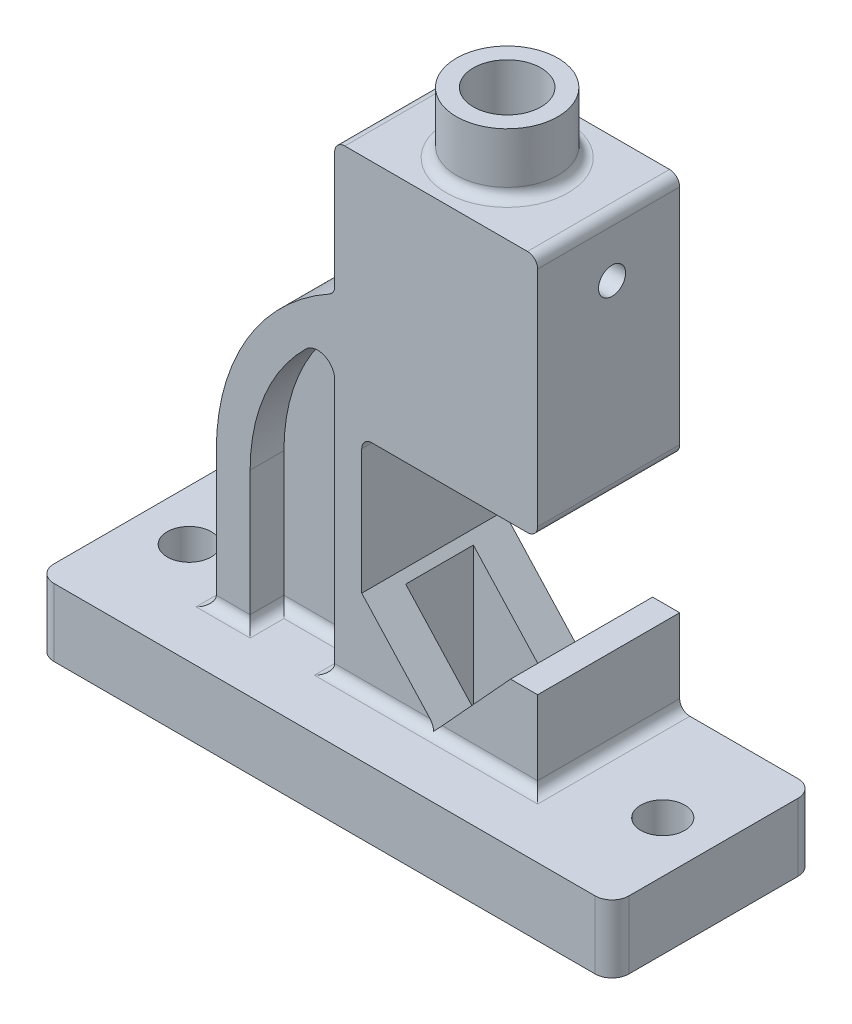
ISO-10303-21;
HEADER;
FILE_DESCRIPTION(('STEP AP214'),'2;1');
FILE_NAME('part.step','',(''),(''),'','','');
FILE_SCHEMA(('AUTOMOTIVE_DESIGN { 1 0 10303 214 1 1 1 1 }'));
ENDSEC;
DATA;
#1=APPLICATION_CONTEXT('core data for automotive mechanical design processes');
#2=APPLICATION_PROTOCOL_DEFINITION('international standard','automotive_design',2000,#1);
#3=PRODUCT_CONTEXT('',#1,'mechanical');
#4=PRODUCT('Part','Part','',(#3));
#5=PRODUCT_RELATED_PRODUCT_CATEGORY('part','',(#4));
#6=PRODUCT_DEFINITION_FORMATION('','',#4);
#7=PRODUCT_DEFINITION_CONTEXT('part definition',#1,'design');
#8=PRODUCT_DEFINITION('design','',#6,#7);
#9=PRODUCT_DEFINITION_SHAPE('','',#8);
#10=(LENGTH_UNIT() NAMED_UNIT(*) SI_UNIT(.MILLI.,.METRE.));
#11=(NAMED_UNIT(*) PLANE_ANGLE_UNIT() SI_UNIT($,.RADIAN.));
#12=(NAMED_UNIT(*) SI_UNIT($,.STERADIAN.) SOLID_ANGLE_UNIT());
#13=UNCERTAINTY_MEASURE_WITH_UNIT(LENGTH_MEASURE(1.E-05),#10,'distance_accuracy_value','');
#14=(GEOMETRIC_REPRESENTATION_CONTEXT(3) GLOBAL_UNCERTAINTY_ASSIGNED_CONTEXT((#13)) GLOBAL_UNIT_ASSIGNED_CONTEXT((#10,
#11,#12)) REPRESENTATION_CONTEXT('',''));
#15=CARTESIAN_POINT('',(0.,0.,0.));
#16=DIRECTION('',(0.,0.,1.));
#17=DIRECTION('',(1.,0.,0.));
#18=AXIS2_PLACEMENT_3D('',#15,#16,#17);
#19=CARTESIAN_POINT('',(15.,60.,12.));
#20=DIRECTION('',(0.,0.,-1.));
#21=DIRECTION('',(-1.,0.,0.));
#22=AXIS2_PLACEMENT_3D('',#19,#20,#21);
#23=PLANE('',#22);
#24=DIRECTION('',(0.,1.,0.));
#25=VECTOR('',#24,1.);
#26=CARTESIAN_POINT('',(-15.,95.7071421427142,12.));
#27=LINE('',#26,#25);
#28=CARTESIAN_POINT('',(-15.,23.,12.));
#29=VERTEX_POINT('',#28);
#30=CARTESIAN_POINT('',(-15.,95.7071421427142,12.));
#31=VERTEX_POINT('',#30);
#32=EDGE_CURVE('E447',#29,#31,#27,.T.);
#33=ORIENTED_EDGE('',*,*,#32,.F.);
#34=DIRECTION('',(-1.,0.,0.));
#35=VECTOR('',#34,1.);
#36=CARTESIAN_POINT('',(15.,23.,12.));
#37=LINE('',#36,#35);
#38=CARTESIAN_POINT('',(13.1592858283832,23.,12.));
#39=VERTEX_POINT('',#38);
#40=EDGE_CURVE('E760',#29,#39,#37,.F.);
#41=ORIENTED_EDGE('',*,*,#40,.T.);
#42=DIRECTION('',(0.675590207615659,-0.737277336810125,0.));
#43=VECTOR('',#42,1.);
#44=CARTESIAN_POINT('',(-6.99999999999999,44.9999999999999,12.));
#45=LINE('',#44,#43);
#46=CARTESIAN_POINT('',(-6.99999999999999,44.9999999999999,12.));
#47=VERTEX_POINT('',#46);
#48=EDGE_CURVE('E507',#47,#39,#45,.T.);
#49=ORIENTED_EDGE('',*,*,#48,.F.);
#50=DIRECTION('',(0.,-1.,0.));
#51=VECTOR('',#50,1.);
#52=CARTESIAN_POINT('',(-6.99999999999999,84.9999999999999,12.));
#53=LINE('',#52,#51);
#54=CARTESIAN_POINT('',(-6.99999999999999,81.9999999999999,12.));
#55=VERTEX_POINT('',#54);
#56=EDGE_CURVE('E505',#55,#47,#53,.T.);
#57=ORIENTED_EDGE('',*,*,#56,.F.);
#58=CARTESIAN_POINT('',(-3.99999999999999,81.9999999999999,12.));
#59=DIRECTION('',(0.,0.,-1.));
#60=DIRECTION('',(-1.,0.,0.));
#61=AXIS2_PLACEMENT_3D('',#58,#59,#60);
#62=CIRCLE('',#61,3.);
#63=CARTESIAN_POINT('',(-3.99999999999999,84.9999999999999,12.));
#64=VERTEX_POINT('',#63);
#65=EDGE_CURVE('E12',#55,#64,#62,.T.);
#66=ORIENTED_EDGE('',*,*,#65,.T.);
#67=DIRECTION('',(-1.,0.,0.));
#68=VECTOR('',#67,1.);
#69=CARTESIAN_POINT('',(45.,85.,12.));
#70=LINE('',#69,#68);
#71=CARTESIAN_POINT('',(42.,85.,12.));
#72=VERTEX_POINT('',#71);
#73=EDGE_CURVE('E502',#72,#64,#70,.T.);
#74=ORIENTED_EDGE('',*,*,#73,.F.);
#75=CARTESIAN_POINT('',(42.,88.,12.));
#76=DIRECTION('',(0.,0.,-1.));
#77=DIRECTION('',(-1.,0.,0.));
#78=AXIS2_PLACEMENT_3D('',#75,#76,#77);
#79=CIRCLE('',#78,3.);
#80=CARTESIAN_POINT('',(45.,88.,12.));
#81=VERTEX_POINT('',#80);
#82=EDGE_CURVE('E767',#72,#81,#79,.F.);
#83=ORIENTED_EDGE('',*,*,#82,.T.);
#84=DIRECTION('',(0.,-1.,0.));
#85=VECTOR('',#84,1.);
#86=CARTESIAN_POINT('',(45.,157.,12.));
#87=LINE('',#86,#85);
#88=CARTESIAN_POINT('',(45.,154.,12.));
#89=VERTEX_POINT('',#88);
#90=EDGE_CURVE('E499',#89,#81,#87,.T.);
#91=ORIENTED_EDGE('',*,*,#90,.F.);
#92=CARTESIAN_POINT('',(42.,154.,12.));
#93=DIRECTION('',(0.,0.,-1.));
#94=DIRECTION('',(-1.,0.,0.));
#95=AXIS2_PLACEMENT_3D('',#92,#93,#94);
#96=CIRCLE('',#95,3.);
#97=CARTESIAN_POINT('',(42.,157.,12.));
#98=VERTEX_POINT('',#97);
#99=EDGE_CURVE('E769',#89,#98,#96,.F.);
#100=ORIENTED_EDGE('',*,*,#99,.T.);
#101=DIRECTION('',(1.,0.,0.));
#102=VECTOR('',#101,1.);
#103=CARTESIAN_POINT('',(-15.,157.,12.));
#104=LINE('',#103,#102);
#105=CARTESIAN_POINT('',(-12.,157.,12.));
#106=VERTEX_POINT('',#105);
#107=EDGE_CURVE('E496',#106,#98,#104,.T.);
#108=ORIENTED_EDGE('',*,*,#107,.F.);
#109=CARTESIAN_POINT('',(-12.,154.,12.));
#110=DIRECTION('',(0.,0.,-1.));
#111=DIRECTION('',(-1.,0.,0.));
#112=AXIS2_PLACEMENT_3D('',#109,#110,#111);
#113=CIRCLE('',#112,3.);
#114=CARTESIAN_POINT('',(-15.,154.,12.));
#115=VERTEX_POINT('',#114);
#116=EDGE_CURVE('E763',#106,#115,#113,.F.);
#117=ORIENTED_EDGE('',*,*,#116,.T.);
#118=DIRECTION('',(0.,1.,0.));
#119=VECTOR('',#118,1.);
#120=CARTESIAN_POINT('',(-15.,117.662812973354,12.));
#121=LINE('',#120,#119);
#122=CARTESIAN_POINT('',(-15.,119.455865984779,12.));
#123=VERTEX_POINT('',#122);
#124=EDGE_CURVE('E493',#123,#115,#121,.T.);
#125=ORIENTED_EDGE('',*,*,#124,.F.);
#126=CARTESIAN_POINT('',(-18.,119.455865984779,12.));
#127=DIRECTION('',(0.,0.,-1.));
#128=DIRECTION('',(-1.,0.,0.));
#129=AXIS2_PLACEMENT_3D('',#126,#127,#128);
#130=CIRCLE('',#129,3.);
#131=CARTESIAN_POINT('',(-16.5441176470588,116.832813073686,12.));
#132=VERTEX_POINT('',#131);
#133=EDGE_CURVE('E647',#123,#132,#130,.T.);
#134=ORIENTED_EDGE('',*,*,#133,.T.);
#135=CARTESIAN_POINT('',(15.,60.,12.));
#136=DIRECTION('',(0.,0.,-1.));
#137=DIRECTION('',(-1.,0.,0.));
#138=AXIS2_PLACEMENT_3D('',#135,#136,#137);
#139=CIRCLE('',#138,65.);
#140=CARTESIAN_POINT('',(-50.,60.,12.));
#141=VERTEX_POINT('',#140);
#142=EDGE_CURVE('E489',#141,#132,#139,.T.);
#143=ORIENTED_EDGE('',*,*,#142,.F.);
#144=DIRECTION('',(0.,1.,0.));
#145=VECTOR('',#144,1.);
#146=CARTESIAN_POINT('',(-50.,20.,12.));
#147=LINE('',#146,#145);
#148=CARTESIAN_POINT('',(-50.,23.,12.));
#149=VERTEX_POINT('',#148);
#150=EDGE_CURVE('E487',#149,#141,#147,.T.);
#151=ORIENTED_EDGE('',*,*,#150,.F.);
#152=DIRECTION('',(-1.,0.,0.));
#153=VECTOR('',#152,1.);
#154=CARTESIAN_POINT('',(15.,23.,12.));
#155=LINE('',#154,#153);
#156=CARTESIAN_POINT('',(-40.,23.,12.));
#157=VERTEX_POINT('',#156);
#158=EDGE_CURVE('E761',#149,#157,#155,.F.);
#159=ORIENTED_EDGE('',*,*,#158,.T.);
#160=DIRECTION('',(0.,-1.,0.));
#161=VECTOR('',#160,1.);
#162=CARTESIAN_POINT('',(-40.,20.,12.));
#163=LINE('',#162,#161);
#164=CARTESIAN_POINT('',(-40.,60.,12.));
#165=VERTEX_POINT('',#164);
#166=EDGE_CURVE('E461',#165,#157,#163,.T.);
#167=ORIENTED_EDGE('',*,*,#166,.F.);
#168=CARTESIAN_POINT('',(15.,60.,12.));
#169=DIRECTION('',(0.,0.,1.));
#170=DIRECTION('',(-1.,0.,0.));
#171=AXIS2_PLACEMENT_3D('',#168,#169,#170);
#172=CIRCLE('',#171,55.);
#173=CARTESIAN_POINT('',(-23.5,99.2778563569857,12.));
#174=VERTEX_POINT('',#173);
#175=EDGE_CURVE('E475',#174,#165,#172,.T.);
#176=ORIENTED_EDGE('',*,*,#175,.F.);
#177=CARTESIAN_POINT('',(-20.,95.7071421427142,12.));
#178=DIRECTION('',(0.,0.,1.));
#179=DIRECTION('',(-1.,0.,0.));
#180=AXIS2_PLACEMENT_3D('',#177,#178,#179);
#181=CIRCLE('',#180,4.99999999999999);
#182=EDGE_CURVE('E472',#31,#174,#181,.T.);
#183=ORIENTED_EDGE('',*,*,#182,.F.);
#184=EDGE_LOOP('',(#33,#41,#49,#57,#66,#74,#83,#91,#100,#108,#117,#125,#134,#143,#151,#159,#167,
#176,#183));
#185=FACE_BOUND('',#184,.T.);
#186=ADVANCED_FACE('F38',(#185),#23,.F.);
#187=CARTESIAN_POINT('',(-15.,147.,12.));
#188=DIRECTION('',(0.,1.,0.));
#189=DIRECTION('',(-1.,0.,0.));
#190=AXIS2_PLACEMENT_3D('',#187,#188,#189);
#191=PLANE('',#190);
#192=DIRECTION('',(1.,0.,0.));
#193=VECTOR('',#192,1.);
#194=CARTESIAN_POINT('',(35.0000000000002,147.,0.999999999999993));
#195=LINE('',#194,#193);
#196=CARTESIAN_POINT('',(15.,147.,0.999999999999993));
#197=VERTEX_POINT('',#196);
#198=CARTESIAN_POINT('',(35.0000000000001,147.,0.999999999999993));
#199=VERTEX_POINT('',#198);
#200=EDGE_CURVE('E378',#197,#199,#195,.T.);
#201=ORIENTED_EDGE('',*,*,#200,.F.);
#202=CARTESIAN_POINT('',(15.,147.,-9.));
#203=DIRECTION('',(0.,1.,0.));
#204=DIRECTION('',(-1.,0.,0.));
#205=AXIS2_PLACEMENT_3D('',#202,#203,#204);
#206=CIRCLE('',#205,10.);
#207=CARTESIAN_POINT('',(15.,147.,-19.));
#208=VERTEX_POINT('',#207);
#209=EDGE_CURVE('E364',#197,#208,#206,.T.);
#210=ORIENTED_EDGE('',*,*,#209,.T.);
#211=DIRECTION('',(-1.,0.,0.));
#212=VECTOR('',#211,1.);
#213=CARTESIAN_POINT('',(35.0000000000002,147.,-19.));
#214=LINE('',#213,#212);
#215=CARTESIAN_POINT('',(35.0000000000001,147.,-19.));
#216=VERTEX_POINT('',#215);
#217=EDGE_CURVE('E376',#216,#208,#214,.T.);
#218=ORIENTED_EDGE('',*,*,#217,.F.);
#219=DIRECTION('',(0.,0.,-1.));
#220=VECTOR('',#219,1.);
#221=CARTESIAN_POINT('',(35.0000000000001,147.,0.999999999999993));
#222=LINE('',#221,#220);
#223=EDGE_CURVE('E384',#199,#216,#222,.T.);
#224=ORIENTED_EDGE('',*,*,#223,.F.);
#225=EDGE_LOOP('',(#201,#210,#218,#224));
#226=FACE_BOUND('',#225,.T.);
#227=ADVANCED_FACE('F373',(#226),#191,.F.);
#228=CARTESIAN_POINT('',(-15.,157.,12.));
#229=DIRECTION('',(0.,1.,0.));
#230=DIRECTION('',(-1.,0.,0.));
#231=AXIS2_PLACEMENT_3D('',#228,#229,#230);
#232=PLANE('',#231);
#233=CARTESIAN_POINT('',(15.,157.,-9.));
#234=DIRECTION('',(0.,1.,0.));
#235=DIRECTION('',(-1.,0.,0.));
#236=AXIS2_PLACEMENT_3D('',#233,#234,#235);
#237=CIRCLE('',#236,18.);
#238=CARTESIAN_POINT('',(-2.99999999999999,157.,-9.));
#239=VERTEX_POINT('',#238);
#240=EDGE_CURVE('E605',#239,#239,#237,.F.);
#241=ORIENTED_EDGE('',*,*,#240,.T.);
#242=EDGE_LOOP('',(#241));
#243=FACE_BOUND('',#242,.T.);
#244=DIRECTION('',(1.,0.,0.));
#245=VECTOR('',#244,1.);
#246=CARTESIAN_POINT('',(-15.,157.,-30.));
#247=LINE('',#246,#245);
#248=CARTESIAN_POINT('',(-12.,157.,-30.));
#249=VERTEX_POINT('',#248);
#250=CARTESIAN_POINT('',(42.,157.,-30.));
#251=VERTEX_POINT('',#250);
#252=EDGE_CURVE('E525',#249,#251,#247,.T.);
#253=ORIENTED_EDGE('',*,*,#252,.F.);
#254=DIRECTION('',(0.,0.,-1.));
#255=VECTOR('',#254,1.);
#256=CARTESIAN_POINT('',(-12.,157.,12.));
#257=LINE('',#256,#255);
#258=EDGE_CURVE('E603',#249,#106,#257,.F.);
#259=ORIENTED_EDGE('',*,*,#258,.T.);
#260=ORIENTED_EDGE('',*,*,#107,.T.);
#261=DIRECTION('',(0.,0.,-1.));
#262=VECTOR('',#261,1.);
#263=CARTESIAN_POINT('',(42.,157.,12.));
#264=LINE('',#263,#262);
#265=EDGE_CURVE('E600',#98,#251,#264,.T.);
#266=ORIENTED_EDGE('',*,*,#265,.T.);
#267=EDGE_LOOP('',(#253,#259,#260,#266));
#268=FACE_BOUND('',#267,.T.);
#269=ADVANCED_FACE('F728',(#243,#268),#232,.T.);
#270=CARTESIAN_POINT('',(-80.,20.,-30.));
#271=DIRECTION('',(0.,0.,1.));
#272=DIRECTION('',(1.,0.,0.));
#273=AXIS2_PLACEMENT_3D('',#270,#271,#272);
#274=PLANE('',#273);
#275=DIRECTION('',(0.,1.,0.));
#276=VECTOR('',#275,1.);
#277=CARTESIAN_POINT('',(-15.,117.662812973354,-30.));
#278=LINE('',#277,#276);
#279=CARTESIAN_POINT('',(-15.,119.455865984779,-30.));
#280=VERTEX_POINT('',#279);
#281=CARTESIAN_POINT('',(-15.,154.,-30.));
#282=VERTEX_POINT('',#281);
#283=EDGE_CURVE('E522',#280,#282,#278,.T.);
#284=ORIENTED_EDGE('',*,*,#283,.T.);
#285=CARTESIAN_POINT('',(-12.,154.,-30.));
#286=DIRECTION('',(0.,0.,1.));
#287=DIRECTION('',(1.,0.,0.));
#288=AXIS2_PLACEMENT_3D('',#285,#286,#287);
#289=CIRCLE('',#288,3.);
#290=EDGE_CURVE('E620',#282,#249,#289,.F.);
#291=ORIENTED_EDGE('',*,*,#290,.T.);
#292=ORIENTED_EDGE('',*,*,#252,.T.);
#293=CARTESIAN_POINT('',(42.,154.,-30.));
#294=DIRECTION('',(0.,0.,1.));
#295=DIRECTION('',(1.,0.,0.));
#296=AXIS2_PLACEMENT_3D('',#293,#294,#295);
#297=CIRCLE('',#296,3.);
#298=CARTESIAN_POINT('',(45.,154.,-30.));
#299=VERTEX_POINT('',#298);
#300=EDGE_CURVE('E616',#251,#299,#297,.F.);
#301=ORIENTED_EDGE('',*,*,#300,.T.);
#302=DIRECTION('',(0.,-1.,0.));
#303=VECTOR('',#302,1.);
#304=CARTESIAN_POINT('',(45.,157.,-30.));
#305=LINE('',#304,#303);
#306=CARTESIAN_POINT('',(45.,88.,-30.));
#307=VERTEX_POINT('',#306);
#308=EDGE_CURVE('E528',#299,#307,#305,.T.);
#309=ORIENTED_EDGE('',*,*,#308,.T.);
#310=CARTESIAN_POINT('',(42.,88.,-30.));
#311=DIRECTION('',(0.,0.,1.));
#312=DIRECTION('',(1.,0.,0.));
#313=AXIS2_PLACEMENT_3D('',#310,#311,#312);
#314=CIRCLE('',#313,3.);
#315=CARTESIAN_POINT('',(42.,85.,-30.));
#316=VERTEX_POINT('',#315);
#317=EDGE_CURVE('E618',#307,#316,#314,.F.);
#318=ORIENTED_EDGE('',*,*,#317,.T.);
#319=DIRECTION('',(-1.,0.,0.));
#320=VECTOR('',#319,1.);
#321=CARTESIAN_POINT('',(45.,85.,-30.));
#322=LINE('',#321,#320);
#323=CARTESIAN_POINT('',(-3.99999999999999,84.9999999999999,-30.));
#324=VERTEX_POINT('',#323);
#325=EDGE_CURVE('E531',#316,#324,#322,.T.);
#326=ORIENTED_EDGE('',*,*,#325,.T.);
#327=CARTESIAN_POINT('',(-3.99999999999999,81.9999999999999,-30.));
#328=DIRECTION('',(0.,0.,1.));
#329=DIRECTION('',(1.,0.,0.));
#330=AXIS2_PLACEMENT_3D('',#327,#328,#329);
#331=CIRCLE('',#330,3.);
#332=CARTESIAN_POINT('',(-6.99999999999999,81.9999999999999,-30.));
#333=VERTEX_POINT('',#332);
#334=EDGE_CURVE('E47',#324,#333,#331,.T.);
#335=ORIENTED_EDGE('',*,*,#334,.T.);
#336=DIRECTION('',(0.,-1.,0.));
#337=VECTOR('',#336,1.);
#338=CARTESIAN_POINT('',(-6.99999999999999,84.9999999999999,-30.));
#339=LINE('',#338,#337);
#340=CARTESIAN_POINT('',(-6.99999999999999,44.9999999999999,-30.));
#341=VERTEX_POINT('',#340);
#342=EDGE_CURVE('E534',#333,#341,#339,.T.);
#343=ORIENTED_EDGE('',*,*,#342,.T.);
#344=DIRECTION('',(0.675590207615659,-0.737277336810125,0.));
#345=VECTOR('',#344,1.);
#346=CARTESIAN_POINT('',(-6.99999999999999,44.9999999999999,-30.));
#347=LINE('',#346,#345);
#348=CARTESIAN_POINT('',(15.,20.9912129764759,-30.));
#349=VERTEX_POINT('',#348);
#350=EDGE_CURVE('E536',#341,#349,#347,.T.);
#351=ORIENTED_EDGE('',*,*,#350,.T.);
#352=DIRECTION('',(0.675590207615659,0.737277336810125,0.));
#353=VECTOR('',#352,1.);
#354=CARTESIAN_POINT('',(15.,20.9912129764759,-30.));
#355=LINE('',#354,#353);
#356=CARTESIAN_POINT('',(37.,44.9999999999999,-30.));
#357=VERTEX_POINT('',#356);
#358=EDGE_CURVE('E539',#349,#357,#355,.T.);
#359=ORIENTED_EDGE('',*,*,#358,.T.);
#360=DIRECTION('',(1.,0.,0.));
#361=VECTOR('',#360,1.);
#362=CARTESIAN_POINT('',(37.,44.9999999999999,-30.));
#363=LINE('',#362,#361);
#364=CARTESIAN_POINT('',(45.,45.,-30.));
#365=VERTEX_POINT('',#364);
#366=EDGE_CURVE('E542',#357,#365,#363,.T.);
#367=ORIENTED_EDGE('',*,*,#366,.T.);
#368=DIRECTION('',(0.,-1.,0.));
#369=VECTOR('',#368,1.);
#370=CARTESIAN_POINT('',(45.,45.,-30.));
#371=LINE('',#370,#369);
#372=CARTESIAN_POINT('',(45.,23.,-30.));
#373=VERTEX_POINT('',#372);
#374=EDGE_CURVE('E490',#365,#373,#371,.T.);
#375=ORIENTED_EDGE('',*,*,#374,.T.);
#376=CARTESIAN_POINT('',(48.,23.,-30.));
#377=DIRECTION('',(0.,0.,1.));
#378=DIRECTION('',(1.,0.,0.));
#379=AXIS2_PLACEMENT_3D('',#376,#377,#378);
#380=CIRCLE('',#379,3.);
#381=CARTESIAN_POINT('',(48.,20.,-30.));
#382=VERTEX_POINT('',#381);
#383=EDGE_CURVE('E636',#373,#382,#380,.T.);
#384=ORIENTED_EDGE('',*,*,#383,.T.);
#385=DIRECTION('',(-1.,0.,0.));
#386=VECTOR('',#385,1.);
#387=CARTESIAN_POINT('',(-80.,20.,-30.));
#388=LINE('',#387,#386);
#389=CARTESIAN_POINT('',(80.,20.,-30.));
#390=VERTEX_POINT('',#389);
#391=EDGE_CURVE('E581',#390,#382,#388,.T.);
#392=ORIENTED_EDGE('',*,*,#391,.F.);
#393=DIRECTION('',(0.,-1.,0.));
#394=VECTOR('',#393,1.);
#395=CARTESIAN_POINT('',(80.,20.,-30.));
#396=LINE('',#395,#394);
#397=CARTESIAN_POINT('',(80.,0.,-30.));
#398=VERTEX_POINT('',#397);
#399=EDGE_CURVE('E834',#390,#398,#396,.T.);
#400=ORIENTED_EDGE('',*,*,#399,.T.);
#401=DIRECTION('',(-1.,0.,0.));
#402=VECTOR('',#401,1.);
#403=CARTESIAN_POINT('',(-80.,0.,-30.));
#404=LINE('',#403,#402);
#405=CARTESIAN_POINT('',(-80.,0.,-30.));
#406=VERTEX_POINT('',#405);
#407=EDGE_CURVE('E850',#398,#406,#404,.T.);
#408=ORIENTED_EDGE('',*,*,#407,.T.);
#409=DIRECTION('',(0.,-1.,0.));
#410=VECTOR('',#409,1.);
#411=CARTESIAN_POINT('',(-80.,20.,-30.));
#412=LINE('',#411,#410);
#413=CARTESIAN_POINT('',(-80.,20.,-30.));
#414=VERTEX_POINT('',#413);
#415=EDGE_CURVE('E837',#414,#406,#412,.T.);
#416=ORIENTED_EDGE('',*,*,#415,.F.);
#417=CARTESIAN_POINT('',(-53.,20.,-30.));
#418=VERTEX_POINT('',#417);
#419=EDGE_CURVE('E571',#418,#414,#388,.T.);
#420=ORIENTED_EDGE('',*,*,#419,.F.);
#421=CARTESIAN_POINT('',(-53.,23.,-30.));
#422=DIRECTION('',(0.,0.,1.));
#423=DIRECTION('',(1.,0.,0.));
#424=AXIS2_PLACEMENT_3D('',#421,#422,#423);
#425=CIRCLE('',#424,3.);
#426=CARTESIAN_POINT('',(-50.,23.,-30.));
#427=VERTEX_POINT('',#426);
#428=EDGE_CURVE('E643',#418,#427,#425,.T.);
#429=ORIENTED_EDGE('',*,*,#428,.T.);
#430=DIRECTION('',(0.,1.,0.));
#431=VECTOR('',#430,1.);
#432=CARTESIAN_POINT('',(-50.,20.,-30.));
#433=LINE('',#432,#431);
#434=CARTESIAN_POINT('',(-50.,60.,-30.));
#435=VERTEX_POINT('',#434);
#436=EDGE_CURVE('E482',#427,#435,#433,.T.);
#437=ORIENTED_EDGE('',*,*,#436,.T.);
#438=CARTESIAN_POINT('',(15.,60.,-30.));
#439=DIRECTION('',(0.,0.,-1.));
#440=DIRECTION('',(-1.,0.,0.));
#441=AXIS2_PLACEMENT_3D('',#438,#439,#440);
#442=CIRCLE('',#441,65.);
#443=CARTESIAN_POINT('',(-16.5441176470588,116.832813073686,-30.));
#444=VERTEX_POINT('',#443);
#445=EDGE_CURVE('E519',#435,#444,#442,.T.);
#446=ORIENTED_EDGE('',*,*,#445,.T.);
#447=CARTESIAN_POINT('',(-18.,119.455865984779,-30.));
#448=DIRECTION('',(0.,0.,1.));
#449=DIRECTION('',(1.,0.,0.));
#450=AXIS2_PLACEMENT_3D('',#447,#448,#449);
#451=CIRCLE('',#450,3.);
#452=EDGE_CURVE('E645',#444,#280,#451,.T.);
#453=ORIENTED_EDGE('',*,*,#452,.T.);
#454=EDGE_LOOP('',(#284,#291,#292,#301,#309,#318,#326,#335,#343,#351,#359,#367,#375,#384,#392,
#400,#408,#416,#420,#429,#437,#446,#453));
#455=FACE_BOUND('',#454,.T.);
#456=DIRECTION('',(-1.,0.,0.));
#457=VECTOR('',#456,1.);
#458=CARTESIAN_POINT('',(-80.,20.,-30.));
#459=LINE('',#458,#457);
#460=CARTESIAN_POINT('',(-15.,20.,-30.));
#461=VERTEX_POINT('',#460);
#462=CARTESIAN_POINT('',(-40.,20.,-30.));
#463=VERTEX_POINT('',#462);
#464=EDGE_CURVE('E803',#461,#463,#459,.T.);
#465=ORIENTED_EDGE('',*,*,#464,.F.);
#466=DIRECTION('',(0.,-1.,0.));
#467=VECTOR('',#466,1.);
#468=CARTESIAN_POINT('',(-15.,20.,-30.));
#469=LINE('',#468,#467);
#470=CARTESIAN_POINT('',(-15.,95.7071421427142,-30.));
#471=VERTEX_POINT('',#470);
#472=EDGE_CURVE('E806',#471,#461,#469,.T.);
#473=ORIENTED_EDGE('',*,*,#472,.F.);
#474=CARTESIAN_POINT('',(-20.,95.7071421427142,-30.));
#475=DIRECTION('',(0.,0.,1.));
#476=DIRECTION('',(1.,0.,0.));
#477=AXIS2_PLACEMENT_3D('',#474,#475,#476);
#478=CIRCLE('',#477,4.99999999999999);
#479=CARTESIAN_POINT('',(-23.5,99.2778563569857,-30.));
#480=VERTEX_POINT('',#479);
#481=EDGE_CURVE('E808',#480,#471,#478,.F.);
#482=ORIENTED_EDGE('',*,*,#481,.F.);
#483=CARTESIAN_POINT('',(15.,60.,-30.));
#484=DIRECTION('',(0.,0.,1.));
#485=DIRECTION('',(1.,0.,0.));
#486=AXIS2_PLACEMENT_3D('',#483,#484,#485);
#487=CIRCLE('',#486,55.);
#488=CARTESIAN_POINT('',(-40.,60.,-30.));
#489=VERTEX_POINT('',#488);
#490=EDGE_CURVE('E810',#489,#480,#487,.F.);
#491=ORIENTED_EDGE('',*,*,#490,.F.);
#492=DIRECTION('',(0.,1.,0.));
#493=VECTOR('',#492,1.);
#494=CARTESIAN_POINT('',(-40.,20.,-30.));
#495=LINE('',#494,#493);
#496=EDGE_CURVE('E812',#463,#489,#495,.T.);
#497=ORIENTED_EDGE('',*,*,#496,.F.);
#498=EDGE_LOOP('',(#465,#473,#482,#491,#497));
#499=FACE_BOUND('',#498,.T.);
#500=ADVANCED_FACE('F893',(#455,#499),#274,.F.);
#501=CARTESIAN_POINT('',(-80.,20.,25.));
#502=DIRECTION('',(0.,-1.,0.));
#503=DIRECTION('',(0.,0.,-1.));
#504=AXIS2_PLACEMENT_3D('',#501,#502,#503);
#505=CYLINDRICAL_SURFACE('',#504,5.);
#506=CARTESIAN_POINT('',(-80.,0.,25.));
#507=DIRECTION('',(0.,1.,0.));
#508=DIRECTION('',(0.,0.,1.));
#509=AXIS2_PLACEMENT_3D('',#506,#507,#508);
#510=CIRCLE('',#509,5.);
#511=CARTESIAN_POINT('',(-85.,0.,25.));
#512=VERTEX_POINT('',#511);
#513=CARTESIAN_POINT('',(-79.9999999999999,0.,30.));
#514=VERTEX_POINT('',#513);
#515=EDGE_CURVE('E547',#512,#514,#510,.T.);
#516=ORIENTED_EDGE('',*,*,#515,.T.);
#517=DIRECTION('',(0.,-1.,0.));
#518=VECTOR('',#517,1.);
#519=CARTESIAN_POINT('',(-79.9999999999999,20.,30.));
#520=LINE('',#519,#518);
#521=CARTESIAN_POINT('',(-79.9999999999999,20.,30.));
#522=VERTEX_POINT('',#521);
#523=EDGE_CURVE('E585',#522,#514,#520,.T.);
#524=ORIENTED_EDGE('',*,*,#523,.F.);
#525=CARTESIAN_POINT('',(-80.,20.,25.));
#526=DIRECTION('',(0.,1.,0.));
#527=DIRECTION('',(0.,0.,1.));
#528=AXIS2_PLACEMENT_3D('',#525,#526,#527);
#529=CIRCLE('',#528,5.);
#530=CARTESIAN_POINT('',(-85.,20.,25.));
#531=VERTEX_POINT('',#530);
#532=EDGE_CURVE('E559',#531,#522,#529,.T.);
#533=ORIENTED_EDGE('',*,*,#532,.F.);
#534=DIRECTION('',(0.,-1.,0.));
#535=VECTOR('',#534,1.);
#536=CARTESIAN_POINT('',(-85.,20.,25.));
#537=LINE('',#536,#535);
#538=EDGE_CURVE('E843',#531,#512,#537,.T.);
#539=ORIENTED_EDGE('',*,*,#538,.T.);
#540=EDGE_LOOP('',(#516,#524,#533,#539));
#541=FACE_BOUND('',#540,.T.);
#542=ADVANCED_FACE('F875',(#541),#505,.T.);
#543=CARTESIAN_POINT('',(-79.9999999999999,20.,30.));
#544=DIRECTION('',(0.,0.,-1.));
#545=DIRECTION('',(-1.,0.,0.));
#546=AXIS2_PLACEMENT_3D('',#543,#544,#545);
#547=PLANE('',#546);
#548=DIRECTION('',(1.,0.,0.));
#549=VECTOR('',#548,1.);
#550=CARTESIAN_POINT('',(-79.9999999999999,0.,30.));
#551=LINE('',#550,#549);
#552=CARTESIAN_POINT('',(80.,0.,30.));
#553=VERTEX_POINT('',#552);
#554=EDGE_CURVE('E858',#514,#553,#551,.T.);
#555=ORIENTED_EDGE('',*,*,#554,.T.);
#556=DIRECTION('',(0.,-1.,0.));
#557=VECTOR('',#556,1.);
#558=CARTESIAN_POINT('',(80.,20.,30.));
#559=LINE('',#558,#557);
#560=CARTESIAN_POINT('',(80.,20.,30.));
#561=VERTEX_POINT('',#560);
#562=EDGE_CURVE('E818',#561,#553,#559,.T.);
#563=ORIENTED_EDGE('',*,*,#562,.F.);
#564=DIRECTION('',(1.,0.,0.));
#565=VECTOR('',#564,1.);
#566=CARTESIAN_POINT('',(-79.9999999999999,20.,30.));
#567=LINE('',#566,#565);
#568=EDGE_CURVE('E562',#522,#561,#567,.T.);
#569=ORIENTED_EDGE('',*,*,#568,.F.);
#570=ORIENTED_EDGE('',*,*,#523,.T.);
#571=EDGE_LOOP('',(#555,#563,#569,#570));
#572=FACE_BOUND('',#571,.T.);
#573=ADVANCED_FACE('F877',(#572),#547,.F.);
#574=CARTESIAN_POINT('',(80.,20.,25.));
#575=DIRECTION('',(0.,-1.,0.));
#576=DIRECTION('',(0.,0.,-1.));
#577=AXIS2_PLACEMENT_3D('',#574,#575,#576);
#578=CYLINDRICAL_SURFACE('',#577,5.);
#579=CARTESIAN_POINT('',(80.,0.,25.));
#580=DIRECTION('',(0.,1.,0.));
#581=DIRECTION('',(0.,0.,1.));
#582=AXIS2_PLACEMENT_3D('',#579,#580,#581);
#583=CIRCLE('',#582,5.);
#584=CARTESIAN_POINT('',(85.,0.,25.));
#585=VERTEX_POINT('',#584);
#586=EDGE_CURVE('E856',#553,#585,#583,.T.);
#587=ORIENTED_EDGE('',*,*,#586,.T.);
#588=DIRECTION('',(0.,-1.,0.));
#589=VECTOR('',#588,1.);
#590=CARTESIAN_POINT('',(85.,20.,25.));
#591=LINE('',#590,#589);
#592=CARTESIAN_POINT('',(85.,20.,25.));
#593=VERTEX_POINT('',#592);
#594=EDGE_CURVE('E823',#593,#585,#591,.T.);
#595=ORIENTED_EDGE('',*,*,#594,.F.);
#596=CARTESIAN_POINT('',(80.,20.,25.));
#597=DIRECTION('',(0.,1.,0.));
#598=DIRECTION('',(0.,0.,1.));
#599=AXIS2_PLACEMENT_3D('',#596,#597,#598);
#600=CIRCLE('',#599,5.);
#601=EDGE_CURVE('E565',#561,#593,#600,.T.);
#602=ORIENTED_EDGE('',*,*,#601,.F.);
#603=ORIENTED_EDGE('',*,*,#562,.T.);
#604=EDGE_LOOP('',(#587,#595,#602,#603));
#605=FACE_BOUND('',#604,.T.);
#606=ADVANCED_FACE('F878',(#605),#578,.T.);
#607=CARTESIAN_POINT('',(85.,20.,-25.));
#608=DIRECTION('',(-1.,0.,0.));
#609=DIRECTION('',(0.,0.,1.));
#610=AXIS2_PLACEMENT_3D('',#607,#608,#609);
#611=PLANE('',#610);
#612=DIRECTION('',(0.,0.,-1.));
#613=VECTOR('',#612,1.);
#614=CARTESIAN_POINT('',(85.,0.,-25.));
#615=LINE('',#614,#613);
#616=CARTESIAN_POINT('',(85.,0.,-25.));
#617=VERTEX_POINT('',#616);
#618=EDGE_CURVE('E854',#585,#617,#615,.T.);
#619=ORIENTED_EDGE('',*,*,#618,.T.);
#620=DIRECTION('',(0.,-1.,0.));
#621=VECTOR('',#620,1.);
#622=CARTESIAN_POINT('',(85.,20.,-25.));
#623=LINE('',#622,#621);
#624=CARTESIAN_POINT('',(85.,20.,-25.));
#625=VERTEX_POINT('',#624);
#626=EDGE_CURVE('E829',#625,#617,#623,.T.);
#627=ORIENTED_EDGE('',*,*,#626,.F.);
#628=DIRECTION('',(0.,0.,-1.));
#629=VECTOR('',#628,1.);
#630=CARTESIAN_POINT('',(85.,20.,-25.));
#631=LINE('',#630,#629);
#632=EDGE_CURVE('E567',#593,#625,#631,.T.);
#633=ORIENTED_EDGE('',*,*,#632,.F.);
#634=ORIENTED_EDGE('',*,*,#594,.T.);
#635=EDGE_LOOP('',(#619,#627,#633,#634));
#636=FACE_BOUND('',#635,.T.);
#637=ADVANCED_FACE('F883',(#636),#611,.F.);
#638=CARTESIAN_POINT('',(80.,20.,-25.));
#639=DIRECTION('',(0.,-1.,0.));
#640=DIRECTION('',(0.,0.,-1.));
#641=AXIS2_PLACEMENT_3D('',#638,#639,#640);
#642=CYLINDRICAL_SURFACE('',#641,5.);
#643=CARTESIAN_POINT('',(80.,0.,-25.));
#644=DIRECTION('',(0.,1.,0.));
#645=DIRECTION('',(0.,0.,-1.));
#646=AXIS2_PLACEMENT_3D('',#643,#644,#645);
#647=CIRCLE('',#646,5.);
#648=EDGE_CURVE('E852',#617,#398,#647,.T.);
#649=ORIENTED_EDGE('',*,*,#648,.T.);
#650=ORIENTED_EDGE('',*,*,#399,.F.);
#651=CARTESIAN_POINT('',(80.,20.,-25.));
#652=DIRECTION('',(0.,1.,0.));
#653=DIRECTION('',(0.,0.,-1.));
#654=AXIS2_PLACEMENT_3D('',#651,#652,#653);
#655=CIRCLE('',#654,5.);
#656=EDGE_CURVE('E569',#625,#390,#655,.T.);
#657=ORIENTED_EDGE('',*,*,#656,.F.);
#658=ORIENTED_EDGE('',*,*,#626,.T.);
#659=EDGE_LOOP('',(#649,#650,#657,#658));
#660=FACE_BOUND('',#659,.T.);
#661=ADVANCED_FACE('F889',(#660),#642,.T.);
#662=CARTESIAN_POINT('',(-80.,20.,-25.));
#663=DIRECTION('',(0.,-1.,0.));
#664=DIRECTION('',(0.,0.,-1.));
#665=AXIS2_PLACEMENT_3D('',#662,#663,#664);
#666=CYLINDRICAL_SURFACE('',#665,5.);
#667=CARTESIAN_POINT('',(-80.,0.,-25.));
#668=DIRECTION('',(0.,1.,0.));
#669=DIRECTION('',(0.,0.,1.));
#670=AXIS2_PLACEMENT_3D('',#667,#668,#669);
#671=CIRCLE('',#670,5.);
#672=CARTESIAN_POINT('',(-85.,0.,-25.));
#673=VERTEX_POINT('',#672);
#674=EDGE_CURVE('E848',#406,#673,#671,.T.);
#675=ORIENTED_EDGE('',*,*,#674,.T.);
#676=DIRECTION('',(0.,-1.,0.));
#677=VECTOR('',#676,1.);
#678=CARTESIAN_POINT('',(-85.,20.,-25.));
#679=LINE('',#678,#677);
#680=CARTESIAN_POINT('',(-85.,20.,-25.));
#681=VERTEX_POINT('',#680);
#682=EDGE_CURVE('E840',#681,#673,#679,.T.);
#683=ORIENTED_EDGE('',*,*,#682,.F.);
#684=CARTESIAN_POINT('',(-80.,20.,-25.));
#685=DIRECTION('',(0.,1.,0.));
#686=DIRECTION('',(0.,0.,1.));
#687=AXIS2_PLACEMENT_3D('',#684,#685,#686);
#688=CIRCLE('',#687,5.);
#689=EDGE_CURVE('E574',#414,#681,#688,.T.);
#690=ORIENTED_EDGE('',*,*,#689,.F.);
#691=ORIENTED_EDGE('',*,*,#415,.T.);
#692=EDGE_LOOP('',(#675,#683,#690,#691));
#693=FACE_BOUND('',#692,.T.);
#694=ADVANCED_FACE('F867',(#693),#666,.T.);
#695=CARTESIAN_POINT('',(-85.,20.,-25.));
#696=DIRECTION('',(1.,0.,0.));
#697=DIRECTION('',(0.,0.,-1.));
#698=AXIS2_PLACEMENT_3D('',#695,#696,#697);
#699=PLANE('',#698);
#700=DIRECTION('',(0.,0.,1.));
#701=VECTOR('',#700,1.);
#702=CARTESIAN_POINT('',(-85.,0.,-25.));
#703=LINE('',#702,#701);
#704=EDGE_CURVE('E563',#673,#512,#703,.T.);
#705=ORIENTED_EDGE('',*,*,#704,.T.);
#706=ORIENTED_EDGE('',*,*,#538,.F.);
#707=DIRECTION('',(0.,0.,1.));
#708=VECTOR('',#707,1.);
#709=CARTESIAN_POINT('',(-85.,20.,-25.));
#710=LINE('',#709,#708);
#711=EDGE_CURVE('E846',#681,#531,#710,.T.);
#712=ORIENTED_EDGE('',*,*,#711,.F.);
#713=ORIENTED_EDGE('',*,*,#682,.T.);
#714=EDGE_LOOP('',(#705,#706,#712,#713));
#715=FACE_BOUND('',#714,.T.);
#716=ADVANCED_FACE('F871',(#715),#699,.F.);
#717=CARTESIAN_POINT('',(-80.,20.,25.));
#718=DIRECTION('',(0.,1.,0.));
#719=DIRECTION('',(0.,0.,1.));
#720=AXIS2_PLACEMENT_3D('',#717,#718,#719);
#721=PLANE('',#720);
#722=CARTESIAN_POINT('',(70.,20.,0.));
#723=DIRECTION('',(0.,1.,0.));
#724=DIRECTION('',(0.,0.,1.));
#725=AXIS2_PLACEMENT_3D('',#722,#723,#724);
#726=CIRCLE('',#725,6.5);
#727=CARTESIAN_POINT('',(70.,20.,6.50000000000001));
#728=VERTEX_POINT('',#727);
#729=EDGE_CURVE('E684',#728,#728,#726,.T.);
#730=ORIENTED_EDGE('',*,*,#729,.F.);
#731=EDGE_LOOP('',(#730));
#732=FACE_BOUND('',#731,.T.);
#733=CARTESIAN_POINT('',(-70.,20.,0.));
#734=DIRECTION('',(0.,1.,0.));
#735=DIRECTION('',(0.,0.,1.));
#736=AXIS2_PLACEMENT_3D('',#733,#734,#735);
#737=CIRCLE('',#736,6.5);
#738=CARTESIAN_POINT('',(-70.,20.,6.5));
#739=VERTEX_POINT('',#738);
#740=EDGE_CURVE('E681',#739,#739,#737,.T.);
#741=ORIENTED_EDGE('',*,*,#740,.F.);
#742=EDGE_LOOP('',(#741));
#743=FACE_BOUND('',#742,.T.);
#744=ORIENTED_EDGE('',*,*,#391,.T.);
#745=DIRECTION('',(0.,0.,-1.));
#746=VECTOR('',#745,1.);
#747=CARTESIAN_POINT('',(48.,20.,12.));
#748=LINE('',#747,#746);
#749=CARTESIAN_POINT('',(48.,20.,15.));
#750=VERTEX_POINT('',#749);
#751=EDGE_CURVE('E775',#382,#750,#748,.F.);
#752=ORIENTED_EDGE('',*,*,#751,.T.);
#753=DIRECTION('',(-1.,0.,0.));
#754=VECTOR('',#753,1.);
#755=CARTESIAN_POINT('',(-80.,20.,15.));
#756=LINE('',#755,#754);
#757=CARTESIAN_POINT('',(-18.,20.,15.));
#758=VERTEX_POINT('',#757);
#759=EDGE_CURVE('E777',#750,#758,#756,.T.);
#760=ORIENTED_EDGE('',*,*,#759,.T.);
#761=DIRECTION('',(0.,0.,1.));
#762=VECTOR('',#761,1.);
#763=CARTESIAN_POINT('',(-18.,20.,25.));
#764=LINE('',#763,#762);
#765=CARTESIAN_POINT('',(-18.,20.,5.));
#766=VERTEX_POINT('',#765);
#767=EDGE_CURVE('E779',#758,#766,#764,.F.);
#768=ORIENTED_EDGE('',*,*,#767,.T.);
#769=DIRECTION('',(1.,0.,0.));
#770=VECTOR('',#769,1.);
#771=CARTESIAN_POINT('',(-80.,20.,5.));
#772=LINE('',#771,#770);
#773=CARTESIAN_POINT('',(-37.,20.,5.));
#774=VERTEX_POINT('',#773);
#775=EDGE_CURVE('E781',#766,#774,#772,.F.);
#776=ORIENTED_EDGE('',*,*,#775,.T.);
#777=DIRECTION('',(0.,0.,1.));
#778=VECTOR('',#777,1.);
#779=CARTESIAN_POINT('',(-37.,20.,25.));
#780=LINE('',#779,#778);
#781=CARTESIAN_POINT('',(-37.,20.,15.));
#782=VERTEX_POINT('',#781);
#783=EDGE_CURVE('E783',#774,#782,#780,.T.);
#784=ORIENTED_EDGE('',*,*,#783,.T.);
#785=DIRECTION('',(-1.,0.,0.));
#786=VECTOR('',#785,1.);
#787=CARTESIAN_POINT('',(-80.,20.,15.));
#788=LINE('',#787,#786);
#789=CARTESIAN_POINT('',(-53.,20.,15.));
#790=VERTEX_POINT('',#789);
#791=EDGE_CURVE('E785',#782,#790,#788,.T.);
#792=ORIENTED_EDGE('',*,*,#791,.T.);
#793=DIRECTION('',(0.,0.,-1.));
#794=VECTOR('',#793,1.);
#795=CARTESIAN_POINT('',(-53.,20.,-30.));
#796=LINE('',#795,#794);
#797=EDGE_CURVE('E786',#790,#418,#796,.T.);
#798=ORIENTED_EDGE('',*,*,#797,.T.);
#799=ORIENTED_EDGE('',*,*,#419,.T.);
#800=ORIENTED_EDGE('',*,*,#689,.T.);
#801=ORIENTED_EDGE('',*,*,#711,.T.);
#802=ORIENTED_EDGE('',*,*,#532,.T.);
#803=ORIENTED_EDGE('',*,*,#568,.T.);
#804=ORIENTED_EDGE('',*,*,#601,.T.);
#805=ORIENTED_EDGE('',*,*,#632,.T.);
#806=ORIENTED_EDGE('',*,*,#656,.T.);
#807=EDGE_LOOP('',(#744,#752,#760,#768,#776,#784,#792,#798,#799,#800,#801,#802,#803,#804,#805,#806));
#808=FACE_BOUND('',#807,.T.);
#809=ADVANCED_FACE('F864',(#732,#743,#808),#721,.T.);
#810=CARTESIAN_POINT('',(-80.,0.,25.));
#811=DIRECTION('',(0.,1.,0.));
#812=DIRECTION('',(0.,0.,1.));
#813=AXIS2_PLACEMENT_3D('',#810,#811,#812);
#814=PLANE('',#813);
#815=CARTESIAN_POINT('',(70.,-1.04083408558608E-13,0.));
#816=DIRECTION('',(0.,1.,0.));
#817=DIRECTION('',(0.,0.,1.));
#818=AXIS2_PLACEMENT_3D('',#815,#816,#817);
#819=CIRCLE('',#818,6.5);
#820=CARTESIAN_POINT('',(70.,-1.04083408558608E-13,6.50000000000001));
#821=VERTEX_POINT('',#820);
#822=EDGE_CURVE('E689',#821,#821,#819,.T.);
#823=ORIENTED_EDGE('',*,*,#822,.T.);
#824=EDGE_LOOP('',(#823));
#825=FACE_BOUND('',#824,.T.);
#826=CARTESIAN_POINT('',(-70.,-1.04083408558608E-13,0.));
#827=DIRECTION('',(0.,1.,0.));
#828=DIRECTION('',(0.,0.,1.));
#829=AXIS2_PLACEMENT_3D('',#826,#827,#828);
#830=CIRCLE('',#829,6.5);
#831=CARTESIAN_POINT('',(-70.,-1.04083408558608E-13,6.5));
#832=VERTEX_POINT('',#831);
#833=EDGE_CURVE('E659',#832,#832,#830,.T.);
#834=ORIENTED_EDGE('',*,*,#833,.T.);
#835=EDGE_LOOP('',(#834));
#836=FACE_BOUND('',#835,.T.);
#837=DIRECTION('',(1.,0.,0.));
#838=VECTOR('',#837,1.);
#839=CARTESIAN_POINT('',(35.,-1.04083408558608E-13,0.999999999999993));
#840=LINE('',#839,#838);
#841=CARTESIAN_POINT('',(-5.00000000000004,0.,0.999999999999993));
#842=VERTEX_POINT('',#841);
#843=CARTESIAN_POINT('',(35.,-1.04083408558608E-13,0.999999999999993));
#844=VERTEX_POINT('',#843);
#845=EDGE_CURVE('E402',#842,#844,#840,.T.);
#846=ORIENTED_EDGE('',*,*,#845,.T.);
#847=DIRECTION('',(0.,0.,-1.));
#848=VECTOR('',#847,1.);
#849=CARTESIAN_POINT('',(35.,-1.04083408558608E-13,0.999999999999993));
#850=LINE('',#849,#848);
#851=CARTESIAN_POINT('',(35.,-1.04083408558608E-13,-19.));
#852=VERTEX_POINT('',#851);
#853=EDGE_CURVE('E389',#844,#852,#850,.T.);
#854=ORIENTED_EDGE('',*,*,#853,.T.);
#855=DIRECTION('',(-1.,0.,0.));
#856=VECTOR('',#855,1.);
#857=CARTESIAN_POINT('',(35.,-1.04083408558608E-13,-19.));
#858=LINE('',#857,#856);
#859=CARTESIAN_POINT('',(-5.00000000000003,0.,-19.));
#860=VERTEX_POINT('',#859);
#861=EDGE_CURVE('E397',#852,#860,#858,.T.);
#862=ORIENTED_EDGE('',*,*,#861,.T.);
#863=DIRECTION('',(0.,0.,1.));
#864=VECTOR('',#863,1.);
#865=CARTESIAN_POINT('',(-5.00000000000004,0.,0.999999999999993));
#866=LINE('',#865,#864);
#867=EDGE_CURVE('E399',#860,#842,#866,.T.);
#868=ORIENTED_EDGE('',*,*,#867,.T.);
#869=EDGE_LOOP('',(#846,#854,#862,#868));
#870=FACE_BOUND('',#869,.T.);
#871=ORIENTED_EDGE('',*,*,#515,.F.);
#872=ORIENTED_EDGE('',*,*,#704,.F.);
#873=ORIENTED_EDGE('',*,*,#674,.F.);
#874=ORIENTED_EDGE('',*,*,#407,.F.);
#875=ORIENTED_EDGE('',*,*,#648,.F.);
#876=ORIENTED_EDGE('',*,*,#618,.F.);
#877=ORIENTED_EDGE('',*,*,#586,.F.);
#878=ORIENTED_EDGE('',*,*,#554,.F.);
#879=EDGE_LOOP('',(#871,#872,#873,#874,#875,#876,#877,#878));
#880=FACE_BOUND('',#879,.T.);
#881=ADVANCED_FACE('F994',(#825,#836,#870,#880),#814,.F.);
#882=CARTESIAN_POINT('',(45.,45.,12.));
#883=DIRECTION('',(1.,0.,0.));
#884=DIRECTION('',(0.,0.,-1.));
#885=AXIS2_PLACEMENT_3D('',#882,#883,#884);
#886=PLANE('',#885);
#887=DIRECTION('',(0.,-1.,0.));
#888=VECTOR('',#887,1.);
#889=CARTESIAN_POINT('',(45.,45.,12.));
#890=LINE('',#889,#888);
#891=CARTESIAN_POINT('',(45.,45.,12.));
#892=VERTEX_POINT('',#891);
#893=CARTESIAN_POINT('',(45.,23.,12.));
#894=VERTEX_POINT('',#893);
#895=EDGE_CURVE('E515',#892,#894,#890,.T.);
#896=ORIENTED_EDGE('',*,*,#895,.T.);
#897=DIRECTION('',(0.,0.,-1.));
#898=VECTOR('',#897,1.);
#899=CARTESIAN_POINT('',(45.,23.,-30.));
#900=LINE('',#899,#898);
#901=EDGE_CURVE('E771',#894,#373,#900,.T.);
#902=ORIENTED_EDGE('',*,*,#901,.T.);
#903=ORIENTED_EDGE('',*,*,#374,.F.);
#904=DIRECTION('',(0.,0.,-1.));
#905=VECTOR('',#904,1.);
#906=CARTESIAN_POINT('',(45.,45.,12.));
#907=LINE('',#906,#905);
#908=EDGE_CURVE('E545',#892,#365,#907,.T.);
#909=ORIENTED_EDGE('',*,*,#908,.F.);
#910=EDGE_LOOP('',(#896,#902,#903,#909));
#911=FACE_BOUND('',#910,.T.);
#912=ADVANCED_FACE('F992',(#911),#886,.T.);
#913=CARTESIAN_POINT('',(37.,44.9999999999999,12.));
#914=DIRECTION('',(0.,1.,0.));
#915=DIRECTION('',(-1.,0.,0.));
#916=AXIS2_PLACEMENT_3D('',#913,#914,#915);
#917=PLANE('',#916);
#918=ORIENTED_EDGE('',*,*,#366,.F.);
#919=DIRECTION('',(0.,0.,-1.));
#920=VECTOR('',#919,1.);
#921=CARTESIAN_POINT('',(37.,44.9999999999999,12.));
#922=LINE('',#921,#920);
#923=CARTESIAN_POINT('',(37.,44.9999999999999,12.));
#924=VERTEX_POINT('',#923);
#925=EDGE_CURVE('E548',#924,#357,#922,.T.);
#926=ORIENTED_EDGE('',*,*,#925,.F.);
#927=DIRECTION('',(1.,0.,0.));
#928=VECTOR('',#927,1.);
#929=CARTESIAN_POINT('',(37.,44.9999999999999,12.));
#930=LINE('',#929,#928);
#931=EDGE_CURVE('E512',#924,#892,#930,.T.);
#932=ORIENTED_EDGE('',*,*,#931,.T.);
#933=ORIENTED_EDGE('',*,*,#908,.T.);
#934=EDGE_LOOP('',(#918,#926,#932,#933));
#935=FACE_BOUND('',#934,.T.);
#936=ADVANCED_FACE('F990',(#935),#917,.T.);
#937=CARTESIAN_POINT('',(15.,20.9912129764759,12.));
#938=DIRECTION('',(-0.737277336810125,0.675590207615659,0.));
#939=DIRECTION('',(-0.675590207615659,-0.737277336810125,0.));
#940=AXIS2_PLACEMENT_3D('',#937,#938,#939);
#941=PLANE('',#940);
#942=DIRECTION('',(0.675590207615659,0.737277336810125,0.));
#943=VECTOR('',#942,1.);
#944=CARTESIAN_POINT('',(15.,20.9912129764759,0.999999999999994));
#945=LINE('',#944,#943);
#946=CARTESIAN_POINT('',(15.,20.9912129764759,0.999999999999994));
#947=VERTEX_POINT('',#946);
#948=CARTESIAN_POINT('',(35.,42.8173829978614,0.999999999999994));
#949=VERTEX_POINT('',#948);
#950=EDGE_CURVE('E425',#947,#949,#945,.T.);
#951=ORIENTED_EDGE('',*,*,#950,.F.);
#952=DIRECTION('',(0.,0.,-1.));
#953=VECTOR('',#952,1.);
#954=CARTESIAN_POINT('',(15.,20.9912129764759,12.));
#955=LINE('',#954,#953);
#956=CARTESIAN_POINT('',(15.,20.9912129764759,12.7718225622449));
#957=VERTEX_POINT('',#956);
#958=EDGE_CURVE('E550',#957,#947,#955,.T.);
#959=ORIENTED_EDGE('',*,*,#958,.F.);
#960=CARTESIAN_POINT('',(16.8407141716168,23.,15.));
#961=DIRECTION('',(-0.737277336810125,0.675590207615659,0.));
#962=DIRECTION('',(-0.675590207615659,-0.737277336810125,0.));
#963=AXIS2_PLACEMENT_3D('',#960,#961,#962);
#964=ELLIPSE('',#963,4.06902511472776,3.);
#965=CARTESIAN_POINT('',(16.8407141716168,23.,12.));
#966=VERTEX_POINT('',#965);
#967=EDGE_CURVE('E641',#957,#966,#964,.F.);
#968=ORIENTED_EDGE('',*,*,#967,.T.);
#969=DIRECTION('',(0.675590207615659,0.737277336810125,0.));
#970=VECTOR('',#969,1.);
#971=CARTESIAN_POINT('',(15.,20.9912129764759,12.));
#972=LINE('',#971,#970);
#973=EDGE_CURVE('E510',#966,#924,#972,.T.);
#974=ORIENTED_EDGE('',*,*,#973,.T.);
#975=ORIENTED_EDGE('',*,*,#925,.T.);
#976=ORIENTED_EDGE('',*,*,#358,.F.);
#977=CARTESIAN_POINT('',(15.,20.9912129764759,-19.));
#978=VERTEX_POINT('',#977);
#979=EDGE_CURVE('E553',#978,#349,#955,.T.);
#980=ORIENTED_EDGE('',*,*,#979,.F.);
#981=DIRECTION('',(-0.675590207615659,-0.737277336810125,0.));
#982=VECTOR('',#981,1.);
#983=CARTESIAN_POINT('',(15.,20.9912129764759,-19.));
#984=LINE('',#983,#982);
#985=CARTESIAN_POINT('',(35.,42.8173829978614,-19.));
#986=VERTEX_POINT('',#985);
#987=EDGE_CURVE('E419',#986,#978,#984,.T.);
#988=ORIENTED_EDGE('',*,*,#987,.F.);
#989=DIRECTION('',(0.,0.,-1.));
#990=VECTOR('',#989,1.);
#991=CARTESIAN_POINT('',(35.,42.8173829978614,12.));
#992=LINE('',#991,#990);
#993=EDGE_CURVE('E427',#949,#986,#992,.T.);
#994=ORIENTED_EDGE('',*,*,#993,.F.);
#995=EDGE_LOOP('',(#951,#959,#968,#974,#975,#976,#980,#988,#994));
#996=FACE_BOUND('',#995,.T.);
#997=ADVANCED_FACE('F987',(#996),#941,.T.);
#998=CARTESIAN_POINT('',(-6.99999999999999,44.9999999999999,12.));
#999=DIRECTION('',(0.737277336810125,0.675590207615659,0.));
#1000=DIRECTION('',(-0.675590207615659,0.737277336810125,0.));
#1001=AXIS2_PLACEMENT_3D('',#998,#999,#1000);
#1002=PLANE('',#1001);
#1003=DIRECTION('',(0.675590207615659,-0.737277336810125,0.));
#1004=VECTOR('',#1003,1.);
#1005=CARTESIAN_POINT('',(-6.99999999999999,44.9999999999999,0.999999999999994));
#1006=LINE('',#1005,#1004);
#1007=CARTESIAN_POINT('',(-5.,42.8173829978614,0.999999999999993));
#1008=VERTEX_POINT('',#1007);
#1009=EDGE_CURVE('E423',#1008,#947,#1006,.T.);
#1010=ORIENTED_EDGE('',*,*,#1009,.F.);
#1011=DIRECTION('',(0.,0.,1.));
#1012=VECTOR('',#1011,1.);
#1013=CARTESIAN_POINT('',(-5.,42.8173829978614,12.));
#1014=LINE('',#1013,#1012);
#1015=CARTESIAN_POINT('',(-4.99999999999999,42.8173829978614,-19.));
#1016=VERTEX_POINT('',#1015);
#1017=EDGE_CURVE('E421',#1016,#1008,#1014,.T.);
#1018=ORIENTED_EDGE('',*,*,#1017,.F.);
#1019=DIRECTION('',(-0.675590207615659,0.737277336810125,0.));
#1020=VECTOR('',#1019,1.);
#1021=CARTESIAN_POINT('',(-6.99999999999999,44.9999999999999,-19.));
#1022=LINE('',#1021,#1020);
#1023=EDGE_CURVE('E407',#978,#1016,#1022,.T.);
#1024=ORIENTED_EDGE('',*,*,#1023,.F.);
#1025=ORIENTED_EDGE('',*,*,#979,.T.);
#1026=ORIENTED_EDGE('',*,*,#350,.F.);
#1027=DIRECTION('',(0.,0.,-1.));
#1028=VECTOR('',#1027,1.);
#1029=CARTESIAN_POINT('',(-6.99999999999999,44.9999999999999,12.));
#1030=LINE('',#1029,#1028);
#1031=EDGE_CURVE('E554',#47,#341,#1030,.T.);
#1032=ORIENTED_EDGE('',*,*,#1031,.F.);
#1033=ORIENTED_EDGE('',*,*,#48,.T.);
#1034=CARTESIAN_POINT('',(13.1592858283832,23.,15.));
#1035=DIRECTION('',(0.737277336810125,0.675590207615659,0.));
#1036=DIRECTION('',(-0.675590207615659,0.737277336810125,0.));
#1037=AXIS2_PLACEMENT_3D('',#1034,#1035,#1036);
#1038=ELLIPSE('',#1037,4.06902511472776,3.);
#1039=EDGE_CURVE('E638',#39,#957,#1038,.F.);
#1040=ORIENTED_EDGE('',*,*,#1039,.T.);
#1041=ORIENTED_EDGE('',*,*,#958,.T.);
#1042=EDGE_LOOP('',(#1010,#1018,#1024,#1025,#1026,#1032,#1033,#1040,#1041));
#1043=FACE_BOUND('',#1042,.T.);
#1044=ADVANCED_FACE('F981',(#1043),#1002,.T.);
#1045=CARTESIAN_POINT('',(-6.99999999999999,84.9999999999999,12.));
#1046=DIRECTION('',(1.,0.,0.));
#1047=DIRECTION('',(0.,1.,0.));
#1048=AXIS2_PLACEMENT_3D('',#1045,#1046,#1047);
#1049=PLANE('',#1048);
#1050=ORIENTED_EDGE('',*,*,#342,.F.);
#1051=DIRECTION('',(0.,0.,-1.));
#1052=VECTOR('',#1051,1.);
#1053=CARTESIAN_POINT('',(-6.99999999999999,81.9999999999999,12.));
#1054=LINE('',#1053,#1052);
#1055=EDGE_CURVE('E629',#333,#55,#1054,.F.);
#1056=ORIENTED_EDGE('',*,*,#1055,.T.);
#1057=ORIENTED_EDGE('',*,*,#56,.T.);
#1058=ORIENTED_EDGE('',*,*,#1031,.T.);
#1059=EDGE_LOOP('',(#1050,#1056,#1057,#1058));
#1060=FACE_BOUND('',#1059,.T.);
#1061=ADVANCED_FACE('F974',(#1060),#1049,.T.);
#1062=CARTESIAN_POINT('',(45.,85.,12.));
#1063=DIRECTION('',(0.,-1.,0.));
#1064=DIRECTION('',(1.,0.,0.));
#1065=AXIS2_PLACEMENT_3D('',#1062,#1063,#1064);
#1066=PLANE('',#1065);
#1067=ORIENTED_EDGE('',*,*,#73,.T.);
#1068=DIRECTION('',(0.,0.,-1.));
#1069=VECTOR('',#1068,1.);
#1070=CARTESIAN_POINT('',(-3.99999999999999,84.9999999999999,-30.));
#1071=LINE('',#1070,#1069);
#1072=CARTESIAN_POINT('',(-3.99999999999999,84.9999999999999,0.999999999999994));
#1073=VERTEX_POINT('',#1072);
#1074=EDGE_CURVE('E626',#64,#1073,#1071,.T.);
#1075=ORIENTED_EDGE('',*,*,#1074,.T.);
#1076=DIRECTION('',(-1.,0.,0.));
#1077=VECTOR('',#1076,1.);
#1078=CARTESIAN_POINT('',(45.,85.,0.999999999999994));
#1079=LINE('',#1078,#1077);
#1080=CARTESIAN_POINT('',(35.,84.9999999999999,0.999999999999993));
#1081=VERTEX_POINT('',#1080);
#1082=EDGE_CURVE('E796',#1081,#1073,#1079,.T.);
#1083=ORIENTED_EDGE('',*,*,#1082,.F.);
#1084=DIRECTION('',(0.,0.,1.));
#1085=VECTOR('',#1084,1.);
#1086=CARTESIAN_POINT('',(35.,85.,12.));
#1087=LINE('',#1086,#1085);
#1088=CARTESIAN_POINT('',(35.,84.9999999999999,-19.));
#1089=VERTEX_POINT('',#1088);
#1090=EDGE_CURVE('E792',#1089,#1081,#1087,.T.);
#1091=ORIENTED_EDGE('',*,*,#1090,.F.);
#1092=DIRECTION('',(1.,0.,0.));
#1093=VECTOR('',#1092,1.);
#1094=CARTESIAN_POINT('',(45.,85.,-19.));
#1095=LINE('',#1094,#1093);
#1096=CARTESIAN_POINT('',(-3.99999999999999,84.9999999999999,-19.));
#1097=VERTEX_POINT('',#1096);
#1098=EDGE_CURVE('E801',#1097,#1089,#1095,.T.);
#1099=ORIENTED_EDGE('',*,*,#1098,.F.);
#1100=DIRECTION('',(0.,0.,-1.));
#1101=VECTOR('',#1100,1.);
#1102=CARTESIAN_POINT('',(-3.99999999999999,84.9999999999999,-30.));
#1103=LINE('',#1102,#1101);
#1104=EDGE_CURVE('E624',#1097,#324,#1103,.T.);
#1105=ORIENTED_EDGE('',*,*,#1104,.T.);
#1106=ORIENTED_EDGE('',*,*,#325,.F.);
#1107=DIRECTION('',(0.,0.,-1.));
#1108=VECTOR('',#1107,1.);
#1109=CARTESIAN_POINT('',(42.,85.,12.));
#1110=LINE('',#1109,#1108);
#1111=EDGE_CURVE('E622',#316,#72,#1110,.F.);
#1112=ORIENTED_EDGE('',*,*,#1111,.T.);
#1113=EDGE_LOOP('',(#1067,#1075,#1083,#1091,#1099,#1105,#1106,#1112));
#1114=FACE_BOUND('',#1113,.T.);
#1115=ADVANCED_FACE('F961',(#1114),#1066,.T.);
#1116=CARTESIAN_POINT('',(45.,157.,12.));
#1117=DIRECTION('',(1.,0.,0.));
#1118=DIRECTION('',(0.,1.,0.));
#1119=AXIS2_PLACEMENT_3D('',#1116,#1117,#1118);
#1120=PLANE('',#1119);
#1121=CARTESIAN_POINT('',(45.,140.,-10.));
#1122=DIRECTION('',(1.,0.,0.));
#1123=DIRECTION('',(0.,1.,0.));
#1124=AXIS2_PLACEMENT_3D('',#1121,#1122,#1123);
#1125=CIRCLE('',#1124,4.);
#1126=CARTESIAN_POINT('',(45.,144.,-10.));
#1127=VERTEX_POINT('',#1126);
#1128=EDGE_CURVE('E698',#1127,#1127,#1125,.T.);
#1129=ORIENTED_EDGE('',*,*,#1128,.F.);
#1130=EDGE_LOOP('',(#1129));
#1131=FACE_BOUND('',#1130,.T.);
#1132=ORIENTED_EDGE('',*,*,#90,.T.);
#1133=DIRECTION('',(0.,0.,-1.));
#1134=VECTOR('',#1133,1.);
#1135=CARTESIAN_POINT('',(45.,88.,12.));
#1136=LINE('',#1135,#1134);
#1137=EDGE_CURVE('E633',#81,#307,#1136,.T.);
#1138=ORIENTED_EDGE('',*,*,#1137,.T.);
#1139=ORIENTED_EDGE('',*,*,#308,.F.);
#1140=DIRECTION('',(0.,0.,-1.));
#1141=VECTOR('',#1140,1.);
#1142=CARTESIAN_POINT('',(45.,154.,12.));
#1143=LINE('',#1142,#1141);
#1144=EDGE_CURVE('E631',#299,#89,#1143,.F.);
#1145=ORIENTED_EDGE('',*,*,#1144,.T.);
#1146=EDGE_LOOP('',(#1132,#1138,#1139,#1145));
#1147=FACE_BOUND('',#1146,.T.);
#1148=ADVANCED_FACE('F951',(#1131,#1147),#1120,.T.);
#1149=CARTESIAN_POINT('',(-15.,117.662812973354,12.));
#1150=DIRECTION('',(-1.,0.,0.));
#1151=DIRECTION('',(0.,0.,1.));
#1152=AXIS2_PLACEMENT_3D('',#1149,#1150,#1151);
#1153=PLANE('',#1152);
#1154=CARTESIAN_POINT('',(-15.,140.,-10.));
#1155=DIRECTION('',(-1.,0.,0.));
#1156=DIRECTION('',(0.,0.,1.));
#1157=AXIS2_PLACEMENT_3D('',#1154,#1155,#1156);
#1158=CIRCLE('',#1157,4.);
#1159=CARTESIAN_POINT('',(-15.,140.,-5.99999999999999));
#1160=VERTEX_POINT('',#1159);
#1161=EDGE_CURVE('E692',#1160,#1160,#1158,.T.);
#1162=ORIENTED_EDGE('',*,*,#1161,.F.);
#1163=EDGE_LOOP('',(#1162));
#1164=FACE_BOUND('',#1163,.T.);
#1165=ORIENTED_EDGE('',*,*,#283,.F.);
#1166=DIRECTION('',(0.,0.,1.));
#1167=VECTOR('',#1166,1.);
#1168=CARTESIAN_POINT('',(-15.,119.455865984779,12.));
#1169=LINE('',#1168,#1167);
#1170=EDGE_CURVE('E614',#280,#123,#1169,.T.);
#1171=ORIENTED_EDGE('',*,*,#1170,.T.);
#1172=ORIENTED_EDGE('',*,*,#124,.T.);
#1173=DIRECTION('',(0.,0.,-1.));
#1174=VECTOR('',#1173,1.);
#1175=CARTESIAN_POINT('',(-15.,154.,12.));
#1176=LINE('',#1175,#1174);
#1177=EDGE_CURVE('E611',#115,#282,#1176,.T.);
#1178=ORIENTED_EDGE('',*,*,#1177,.T.);
#1179=EDGE_LOOP('',(#1165,#1171,#1172,#1178));
#1180=FACE_BOUND('',#1179,.T.);
#1181=ADVANCED_FACE('F933',(#1164,#1180),#1153,.T.);
#1182=CARTESIAN_POINT('',(15.,60.,12.));
#1183=DIRECTION('',(0.,0.,-1.));
#1184=DIRECTION('',(-1.,0.,0.));
#1185=AXIS2_PLACEMENT_3D('',#1182,#1183,#1184);
#1186=CYLINDRICAL_SURFACE('',#1185,65.);
#1187=ORIENTED_EDGE('',*,*,#142,.T.);
#1188=DIRECTION('',(0.,0.,-1.));
#1189=VECTOR('',#1188,1.);
#1190=CARTESIAN_POINT('',(-16.5441176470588,116.832813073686,12.));
#1191=LINE('',#1190,#1189);
#1192=EDGE_CURVE('E608',#132,#444,#1191,.T.);
#1193=ORIENTED_EDGE('',*,*,#1192,.T.);
#1194=ORIENTED_EDGE('',*,*,#445,.F.);
#1195=DIRECTION('',(0.,0.,-1.));
#1196=VECTOR('',#1195,1.);
#1197=CARTESIAN_POINT('',(-50.,60.,12.));
#1198=LINE('',#1197,#1196);
#1199=EDGE_CURVE('E518',#141,#435,#1198,.T.);
#1200=ORIENTED_EDGE('',*,*,#1199,.F.);
#1201=EDGE_LOOP('',(#1187,#1193,#1194,#1200));
#1202=FACE_BOUND('',#1201,.T.);
#1203=ADVANCED_FACE('F744',(#1202),#1186,.T.);
#1204=CARTESIAN_POINT('',(-50.,20.,12.));
#1205=DIRECTION('',(-1.,0.,0.));
#1206=DIRECTION('',(0.,0.,1.));
#1207=AXIS2_PLACEMENT_3D('',#1204,#1205,#1206);
#1208=PLANE('',#1207);
#1209=ORIENTED_EDGE('',*,*,#436,.F.);
#1210=DIRECTION('',(0.,0.,-1.));
#1211=VECTOR('',#1210,1.);
#1212=CARTESIAN_POINT('',(-50.,23.,12.));
#1213=LINE('',#1212,#1211);
#1214=EDGE_CURVE('E595',#427,#149,#1213,.F.);
#1215=ORIENTED_EDGE('',*,*,#1214,.T.);
#1216=ORIENTED_EDGE('',*,*,#150,.T.);
#1217=ORIENTED_EDGE('',*,*,#1199,.T.);
#1218=EDGE_LOOP('',(#1209,#1215,#1216,#1217));
#1219=FACE_BOUND('',#1218,.T.);
#1220=ADVANCED_FACE('F735',(#1219),#1208,.T.);
#1221=ORIENTED_EDGE('',*,*,#973,.F.);
#1222=DIRECTION('',(-1.,0.,0.));
#1223=VECTOR('',#1222,1.);
#1224=CARTESIAN_POINT('',(15.,23.,12.));
#1225=LINE('',#1224,#1223);
#1226=EDGE_CURVE('E751',#966,#894,#1225,.F.);
#1227=ORIENTED_EDGE('',*,*,#1226,.T.);
#1228=ORIENTED_EDGE('',*,*,#895,.F.);
#1229=ORIENTED_EDGE('',*,*,#931,.F.);
#1230=EDGE_LOOP('',(#1221,#1227,#1228,#1229));
#1231=FACE_BOUND('',#1230,.T.);
#1232=ADVANCED_FACE('F724',(#1231),#23,.F.);
#1233=CARTESIAN_POINT('',(-40.,20.,2.));
#1234=DIRECTION('',(-1.,0.,0.));
#1235=DIRECTION('',(0.,0.,1.));
#1236=AXIS2_PLACEMENT_3D('',#1233,#1234,#1235);
#1237=PLANE('',#1236);
#1238=ORIENTED_EDGE('',*,*,#166,.T.);
#1239=DIRECTION('',(0.,0.,1.));
#1240=VECTOR('',#1239,1.);
#1241=CARTESIAN_POINT('',(-40.,23.,2.));
#1242=LINE('',#1241,#1240);
#1243=CARTESIAN_POINT('',(-40.,23.,2.));
#1244=VERTEX_POINT('',#1243);
#1245=EDGE_CURVE('E593',#157,#1244,#1242,.F.);
#1246=ORIENTED_EDGE('',*,*,#1245,.T.);
#1247=DIRECTION('',(0.,-1.,0.));
#1248=VECTOR('',#1247,1.);
#1249=CARTESIAN_POINT('',(-40.,20.,2.));
#1250=LINE('',#1249,#1248);
#1251=CARTESIAN_POINT('',(-40.,60.,2.));
#1252=VERTEX_POINT('',#1251);
#1253=EDGE_CURVE('E467',#1252,#1244,#1250,.T.);
#1254=ORIENTED_EDGE('',*,*,#1253,.F.);
#1255=DIRECTION('',(0.,0.,1.));
#1256=VECTOR('',#1255,1.);
#1257=CARTESIAN_POINT('',(-40.,60.,2.));
#1258=LINE('',#1257,#1256);
#1259=EDGE_CURVE('E480',#1252,#165,#1258,.T.);
#1260=ORIENTED_EDGE('',*,*,#1259,.T.);
#1261=EDGE_LOOP('',(#1238,#1246,#1254,#1260));
#1262=FACE_BOUND('',#1261,.T.);
#1263=ADVANCED_FACE('F734',(#1262),#1237,.F.);
#1264=CARTESIAN_POINT('',(15.,60.,2.));
#1265=DIRECTION('',(0.,0.,1.));
#1266=DIRECTION('',(1.,0.,0.));
#1267=AXIS2_PLACEMENT_3D('',#1264,#1265,#1266);
#1268=CYLINDRICAL_SURFACE('',#1267,55.);
#1269=ORIENTED_EDGE('',*,*,#175,.T.);
#1270=ORIENTED_EDGE('',*,*,#1259,.F.);
#1271=CARTESIAN_POINT('',(15.,60.,2.));
#1272=DIRECTION('',(0.,0.,1.));
#1273=DIRECTION('',(-1.,0.,0.));
#1274=AXIS2_PLACEMENT_3D('',#1271,#1272,#1273);
#1275=CIRCLE('',#1274,55.);
#1276=CARTESIAN_POINT('',(-23.5,99.2778563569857,2.));
#1277=VERTEX_POINT('',#1276);
#1278=EDGE_CURVE('E464',#1277,#1252,#1275,.T.);
#1279=ORIENTED_EDGE('',*,*,#1278,.F.);
#1280=DIRECTION('',(0.,0.,1.));
#1281=VECTOR('',#1280,1.);
#1282=CARTESIAN_POINT('',(-23.5,99.2778563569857,2.));
#1283=LINE('',#1282,#1281);
#1284=EDGE_CURVE('E483',#1277,#174,#1283,.T.);
#1285=ORIENTED_EDGE('',*,*,#1284,.T.);
#1286=EDGE_LOOP('',(#1269,#1270,#1279,#1285));
#1287=FACE_BOUND('',#1286,.T.);
#1288=ADVANCED_FACE('F741',(#1287),#1268,.F.);
#1289=CARTESIAN_POINT('',(-20.,95.7071421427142,2.));
#1290=DIRECTION('',(0.,0.,1.));
#1291=DIRECTION('',(1.,0.,0.));
#1292=AXIS2_PLACEMENT_3D('',#1289,#1290,#1291);
#1293=CYLINDRICAL_SURFACE('',#1292,4.99999999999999);
#1294=ORIENTED_EDGE('',*,*,#182,.T.);
#1295=ORIENTED_EDGE('',*,*,#1284,.F.);
#1296=CARTESIAN_POINT('',(-20.,95.7071421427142,2.));
#1297=DIRECTION('',(0.,0.,1.));
#1298=DIRECTION('',(-1.,0.,0.));
#1299=AXIS2_PLACEMENT_3D('',#1296,#1297,#1298);
#1300=CIRCLE('',#1299,4.99999999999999);
#1301=CARTESIAN_POINT('',(-15.,95.7071421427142,2.));
#1302=VERTEX_POINT('',#1301);
#1303=EDGE_CURVE('E460',#1302,#1277,#1300,.T.);
#1304=ORIENTED_EDGE('',*,*,#1303,.F.);
#1305=DIRECTION('',(0.,0.,1.));
#1306=VECTOR('',#1305,1.);
#1307=CARTESIAN_POINT('',(-15.,95.7071421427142,2.));
#1308=LINE('',#1307,#1306);
#1309=EDGE_CURVE('E470',#1302,#31,#1308,.T.);
#1310=ORIENTED_EDGE('',*,*,#1309,.T.);
#1311=EDGE_LOOP('',(#1294,#1295,#1304,#1310));
#1312=FACE_BOUND('',#1311,.T.);
#1313=ADVANCED_FACE('F1134',(#1312),#1293,.F.);
#1314=CARTESIAN_POINT('',(-15.,95.7071421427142,2.));
#1315=DIRECTION('',(1.,0.,0.));
#1316=DIRECTION('',(0.,1.,0.));
#1317=AXIS2_PLACEMENT_3D('',#1314,#1315,#1316);
#1318=PLANE('',#1317);
#1319=DIRECTION('',(0.,1.,0.));
#1320=VECTOR('',#1319,1.);
#1321=CARTESIAN_POINT('',(-15.,95.7071421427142,2.));
#1322=LINE('',#1321,#1320);
#1323=CARTESIAN_POINT('',(-15.,23.,2.));
#1324=VERTEX_POINT('',#1323);
#1325=EDGE_CURVE('E458',#1324,#1302,#1322,.T.);
#1326=ORIENTED_EDGE('',*,*,#1325,.F.);
#1327=DIRECTION('',(0.,0.,1.));
#1328=VECTOR('',#1327,1.);
#1329=CARTESIAN_POINT('',(-15.,23.,2.));
#1330=LINE('',#1329,#1328);
#1331=EDGE_CURVE('E773',#1324,#29,#1330,.T.);
#1332=ORIENTED_EDGE('',*,*,#1331,.T.);
#1333=ORIENTED_EDGE('',*,*,#32,.T.);
#1334=ORIENTED_EDGE('',*,*,#1309,.F.);
#1335=EDGE_LOOP('',(#1326,#1332,#1333,#1334));
#1336=FACE_BOUND('',#1335,.T.);
#1337=ADVANCED_FACE('F1130',(#1336),#1318,.F.);
#1338=CARTESIAN_POINT('',(15.,60.,2.));
#1339=DIRECTION('',(0.,0.,-1.));
#1340=DIRECTION('',(-1.,0.,0.));
#1341=AXIS2_PLACEMENT_3D('',#1338,#1339,#1340);
#1342=PLANE('',#1341);
#1343=ORIENTED_EDGE('',*,*,#1253,.T.);
#1344=DIRECTION('',(1.,0.,0.));
#1345=VECTOR('',#1344,1.);
#1346=CARTESIAN_POINT('',(15.,23.,2.));
#1347=LINE('',#1346,#1345);
#1348=EDGE_CURVE('E787',#1244,#1324,#1347,.T.);
#1349=ORIENTED_EDGE('',*,*,#1348,.T.);
#1350=ORIENTED_EDGE('',*,*,#1325,.T.);
#1351=ORIENTED_EDGE('',*,*,#1303,.T.);
#1352=ORIENTED_EDGE('',*,*,#1278,.T.);
#1353=EDGE_LOOP('',(#1343,#1349,#1350,#1351,#1352));
#1354=FACE_BOUND('',#1353,.T.);
#1355=ADVANCED_FACE('F1127',(#1354),#1342,.F.);
#1356=CARTESIAN_POINT('',(-15.,20.,-22.));
#1357=DIRECTION('',(0.,1.,0.));
#1358=DIRECTION('',(0.,0.,1.));
#1359=AXIS2_PLACEMENT_3D('',#1356,#1357,#1358);
#1360=PLANE('',#1359);
#1361=ORIENTED_EDGE('',*,*,#464,.T.);
#1362=DIRECTION('',(0.,0.,-1.));
#1363=VECTOR('',#1362,1.);
#1364=CARTESIAN_POINT('',(-40.,20.,-22.));
#1365=LINE('',#1364,#1363);
#1366=CARTESIAN_POINT('',(-40.,20.,-22.));
#1367=VERTEX_POINT('',#1366);
#1368=EDGE_CURVE('E443',#1367,#463,#1365,.T.);
#1369=ORIENTED_EDGE('',*,*,#1368,.F.);
#1370=DIRECTION('',(1.,0.,0.));
#1371=VECTOR('',#1370,1.);
#1372=CARTESIAN_POINT('',(-15.,20.,-22.));
#1373=LINE('',#1372,#1371);
#1374=CARTESIAN_POINT('',(-15.,20.,-22.));
#1375=VERTEX_POINT('',#1374);
#1376=EDGE_CURVE('E432',#1367,#1375,#1373,.T.);
#1377=ORIENTED_EDGE('',*,*,#1376,.T.);
#1378=DIRECTION('',(0.,0.,-1.));
#1379=VECTOR('',#1378,1.);
#1380=CARTESIAN_POINT('',(-15.,20.,-22.));
#1381=LINE('',#1380,#1379);
#1382=EDGE_CURVE('E444',#1375,#461,#1381,.T.);
#1383=ORIENTED_EDGE('',*,*,#1382,.T.);
#1384=EDGE_LOOP('',(#1361,#1369,#1377,#1383));
#1385=FACE_BOUND('',#1384,.T.);
#1386=ADVANCED_FACE('F1114',(#1385),#1360,.T.);
#1387=CARTESIAN_POINT('',(-15.,95.7071421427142,-22.));
#1388=DIRECTION('',(-1.,0.,0.));
#1389=DIRECTION('',(0.,-1.,0.));
#1390=AXIS2_PLACEMENT_3D('',#1387,#1388,#1389);
#1391=PLANE('',#1390);
#1392=ORIENTED_EDGE('',*,*,#472,.T.);
#1393=ORIENTED_EDGE('',*,*,#1382,.F.);
#1394=DIRECTION('',(0.,1.,0.));
#1395=VECTOR('',#1394,1.);
#1396=CARTESIAN_POINT('',(-15.,95.7071421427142,-22.));
#1397=LINE('',#1396,#1395);
#1398=CARTESIAN_POINT('',(-15.,95.7071421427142,-22.));
#1399=VERTEX_POINT('',#1398);
#1400=EDGE_CURVE('E441',#1375,#1399,#1397,.T.);
#1401=ORIENTED_EDGE('',*,*,#1400,.T.);
#1402=DIRECTION('',(0.,0.,-1.));
#1403=VECTOR('',#1402,1.);
#1404=CARTESIAN_POINT('',(-15.,95.7071421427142,-22.));
#1405=LINE('',#1404,#1403);
#1406=EDGE_CURVE('E448',#1399,#471,#1405,.T.);
#1407=ORIENTED_EDGE('',*,*,#1406,.T.);
#1408=EDGE_LOOP('',(#1392,#1393,#1401,#1407));
#1409=FACE_BOUND('',#1408,.T.);
#1410=ADVANCED_FACE('F1110',(#1409),#1391,.T.);
#1411=CARTESIAN_POINT('',(-20.,95.7071421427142,-22.));
#1412=DIRECTION('',(0.,0.,-1.));
#1413=DIRECTION('',(-1.,0.,0.));
#1414=AXIS2_PLACEMENT_3D('',#1411,#1412,#1413);
#1415=CYLINDRICAL_SURFACE('',#1414,4.99999999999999);
#1416=ORIENTED_EDGE('',*,*,#481,.T.);
#1417=ORIENTED_EDGE('',*,*,#1406,.F.);
#1418=CARTESIAN_POINT('',(-20.,95.7071421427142,-22.));
#1419=DIRECTION('',(0.,0.,1.));
#1420=DIRECTION('',(-1.,0.,0.));
#1421=AXIS2_PLACEMENT_3D('',#1418,#1419,#1420);
#1422=CIRCLE('',#1421,4.99999999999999);
#1423=CARTESIAN_POINT('',(-23.5,99.2778563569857,-22.));
#1424=VERTEX_POINT('',#1423);
#1425=EDGE_CURVE('E439',#1399,#1424,#1422,.T.);
#1426=ORIENTED_EDGE('',*,*,#1425,.T.);
#1427=DIRECTION('',(0.,0.,-1.));
#1428=VECTOR('',#1427,1.);
#1429=CARTESIAN_POINT('',(-23.5,99.2778563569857,-22.));
#1430=LINE('',#1429,#1428);
#1431=EDGE_CURVE('E451',#1424,#480,#1430,.T.);
#1432=ORIENTED_EDGE('',*,*,#1431,.T.);
#1433=EDGE_LOOP('',(#1416,#1417,#1426,#1432));
#1434=FACE_BOUND('',#1433,.T.);
#1435=ADVANCED_FACE('F1113',(#1434),#1415,.F.);
#1436=CARTESIAN_POINT('',(15.,60.,-22.));
#1437=DIRECTION('',(0.,0.,-1.));
#1438=DIRECTION('',(-1.,0.,0.));
#1439=AXIS2_PLACEMENT_3D('',#1436,#1437,#1438);
#1440=CYLINDRICAL_SURFACE('',#1439,55.);
#1441=ORIENTED_EDGE('',*,*,#490,.T.);
#1442=ORIENTED_EDGE('',*,*,#1431,.F.);
#1443=CARTESIAN_POINT('',(15.,60.,-22.));
#1444=DIRECTION('',(0.,0.,1.));
#1445=DIRECTION('',(-1.,0.,0.));
#1446=AXIS2_PLACEMENT_3D('',#1443,#1444,#1445);
#1447=CIRCLE('',#1446,55.);
#1448=CARTESIAN_POINT('',(-40.,60.,-22.));
#1449=VERTEX_POINT('',#1448);
#1450=EDGE_CURVE('E437',#1424,#1449,#1447,.T.);
#1451=ORIENTED_EDGE('',*,*,#1450,.T.);
#1452=DIRECTION('',(0.,0.,-1.));
#1453=VECTOR('',#1452,1.);
#1454=CARTESIAN_POINT('',(-40.,60.,-22.));
#1455=LINE('',#1454,#1453);
#1456=EDGE_CURVE('E454',#1449,#489,#1455,.T.);
#1457=ORIENTED_EDGE('',*,*,#1456,.T.);
#1458=EDGE_LOOP('',(#1441,#1442,#1451,#1457));
#1459=FACE_BOUND('',#1458,.T.);
#1460=ADVANCED_FACE('F1118',(#1459),#1440,.F.);
#1461=CARTESIAN_POINT('',(-40.,20.,-22.));
#1462=DIRECTION('',(1.,0.,0.));
#1463=DIRECTION('',(0.,0.,-1.));
#1464=AXIS2_PLACEMENT_3D('',#1461,#1462,#1463);
#1465=PLANE('',#1464);
#1466=ORIENTED_EDGE('',*,*,#496,.T.);
#1467=ORIENTED_EDGE('',*,*,#1456,.F.);
#1468=DIRECTION('',(0.,-1.,0.));
#1469=VECTOR('',#1468,1.);
#1470=CARTESIAN_POINT('',(-40.,20.,-22.));
#1471=LINE('',#1470,#1469);
#1472=EDGE_CURVE('E435',#1449,#1367,#1471,.T.);
#1473=ORIENTED_EDGE('',*,*,#1472,.T.);
#1474=ORIENTED_EDGE('',*,*,#1368,.T.);
#1475=EDGE_LOOP('',(#1466,#1467,#1473,#1474));
#1476=FACE_BOUND('',#1475,.T.);
#1477=ADVANCED_FACE('F1108',(#1476),#1465,.T.);
#1478=CARTESIAN_POINT('',(15.,60.,-22.));
#1479=DIRECTION('',(0.,0.,1.));
#1480=DIRECTION('',(-1.,0.,0.));
#1481=AXIS2_PLACEMENT_3D('',#1478,#1479,#1480);
#1482=PLANE('',#1481);
#1483=ORIENTED_EDGE('',*,*,#1376,.F.);
#1484=ORIENTED_EDGE('',*,*,#1472,.F.);
#1485=ORIENTED_EDGE('',*,*,#1450,.F.);
#1486=ORIENTED_EDGE('',*,*,#1425,.F.);
#1487=ORIENTED_EDGE('',*,*,#1400,.F.);
#1488=EDGE_LOOP('',(#1483,#1484,#1485,#1486,#1487));
#1489=FACE_BOUND('',#1488,.T.);
#1490=ADVANCED_FACE('F1104',(#1489),#1482,.F.);
#1491=CARTESIAN_POINT('',(15.,175.,-9.));
#1492=DIRECTION('',(0.,-1.,0.));
#1493=DIRECTION('',(0.,0.,-1.));
#1494=AXIS2_PLACEMENT_3D('',#1491,#1492,#1493);
#1495=CYLINDRICAL_SURFACE('',#1494,15.);
#1496=CARTESIAN_POINT('',(15.,160.,-9.));
#1497=DIRECTION('',(0.,1.,0.));
#1498=DIRECTION('',(-1.,0.,0.));
#1499=AXIS2_PLACEMENT_3D('',#1496,#1497,#1498);
#1500=CIRCLE('',#1499,15.);
#1501=CARTESIAN_POINT('',(0.,160.,-9.));
#1502=VERTEX_POINT('',#1501);
#1503=EDGE_CURVE('E597',#1502,#1502,#1500,.T.);
#1504=ORIENTED_EDGE('',*,*,#1503,.T.);
#1505=EDGE_LOOP('',(#1504));
#1506=FACE_BOUND('',#1505,.T.);
#1507=CARTESIAN_POINT('',(15.,175.,-9.));
#1508=DIRECTION('',(0.,1.,0.));
#1509=DIRECTION('',(0.,0.,1.));
#1510=AXIS2_PLACEMENT_3D('',#1507,#1508,#1509);
#1511=CIRCLE('',#1510,15.);
#1512=CARTESIAN_POINT('',(15.,175.,6.));
#1513=VERTEX_POINT('',#1512);
#1514=EDGE_CURVE('E429',#1513,#1513,#1511,.T.);
#1515=ORIENTED_EDGE('',*,*,#1514,.F.);
#1516=EDGE_LOOP('',(#1515));
#1517=FACE_BOUND('',#1516,.T.);
#1518=ADVANCED_FACE('F1100',(#1506,#1517),#1495,.T.);
#1519=CARTESIAN_POINT('',(15.,175.,-9.));
#1520=DIRECTION('',(0.,1.,0.));
#1521=DIRECTION('',(0.,0.,1.));
#1522=AXIS2_PLACEMENT_3D('',#1519,#1520,#1521);
#1523=PLANE('',#1522);
#1524=CARTESIAN_POINT('',(15.,175.,-9.));
#1525=DIRECTION('',(0.,1.,0.));
#1526=DIRECTION('',(0.,0.,1.));
#1527=AXIS2_PLACEMENT_3D('',#1524,#1525,#1526);
#1528=CIRCLE('',#1527,10.);
#1529=CARTESIAN_POINT('',(15.,175.,1.));
#1530=VERTEX_POINT('',#1529);
#1531=EDGE_CURVE('E369',#1530,#1530,#1528,.T.);
#1532=ORIENTED_EDGE('',*,*,#1531,.F.);
#1533=EDGE_LOOP('',(#1532));
#1534=FACE_BOUND('',#1533,.T.);
#1535=ORIENTED_EDGE('',*,*,#1514,.T.);
#1536=EDGE_LOOP('',(#1535));
#1537=FACE_BOUND('',#1536,.T.);
#1538=ADVANCED_FACE('F1082',(#1534,#1537),#1523,.T.);
#1539=CARTESIAN_POINT('',(-4.99999999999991,147.,-19.));
#1540=VERTEX_POINT('',#1539);
#1541=EDGE_CURVE('E381',#208,#1540,#214,.T.);
#1542=ORIENTED_EDGE('',*,*,#1541,.F.);
#1543=EDGE_CURVE('E361',#208,#197,#206,.T.);
#1544=ORIENTED_EDGE('',*,*,#1543,.T.);
#1545=CARTESIAN_POINT('',(-4.99999999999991,147.,0.999999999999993));
#1546=VERTEX_POINT('',#1545);
#1547=EDGE_CURVE('E393',#1546,#197,#195,.T.);
#1548=ORIENTED_EDGE('',*,*,#1547,.F.);
#1549=DIRECTION('',(0.,0.,1.));
#1550=VECTOR('',#1549,1.);
#1551=CARTESIAN_POINT('',(-4.99999999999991,147.,0.999999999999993));
#1552=LINE('',#1551,#1550);
#1553=EDGE_CURVE('E383',#1540,#1546,#1552,.T.);
#1554=ORIENTED_EDGE('',*,*,#1553,.F.);
#1555=EDGE_LOOP('',(#1542,#1544,#1548,#1554));
#1556=FACE_BOUND('',#1555,.T.);
#1557=ADVANCED_FACE('F382',(#1556),#191,.F.);
#1558=CARTESIAN_POINT('',(35.,-1.04083408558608E-13,-19.));
#1559=DIRECTION('',(0.,0.,-1.));
#1560=DIRECTION('',(-1.,0.,0.));
#1561=AXIS2_PLACEMENT_3D('',#1558,#1559,#1560);
#1562=PLANE('',#1561);
#1563=DIRECTION('',(0.,1.,0.));
#1564=VECTOR('',#1563,1.);
#1565=CARTESIAN_POINT('',(-5.00000000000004,0.,-19.));
#1566=LINE('',#1565,#1564);
#1567=CARTESIAN_POINT('',(-4.99999999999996,84.8284271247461,-19.));
#1568=VERTEX_POINT('',#1567);
#1569=EDGE_CURVE('E55',#1568,#1540,#1566,.T.);
#1570=ORIENTED_EDGE('',*,*,#1569,.F.);
#1571=CARTESIAN_POINT('',(-3.99999999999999,81.9999999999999,-19.));
#1572=DIRECTION('',(0.,0.,-1.));
#1573=DIRECTION('',(-1.,0.,0.));
#1574=AXIS2_PLACEMENT_3D('',#1571,#1572,#1573);
#1575=CIRCLE('',#1574,3.);
#1576=EDGE_CURVE('E653',#1568,#1097,#1575,.T.);
#1577=ORIENTED_EDGE('',*,*,#1576,.T.);
#1578=ORIENTED_EDGE('',*,*,#1098,.T.);
#1579=DIRECTION('',(0.,1.,0.));
#1580=VECTOR('',#1579,1.);
#1581=CARTESIAN_POINT('',(35.,-1.04083408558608E-13,-19.));
#1582=LINE('',#1581,#1580);
#1583=EDGE_CURVE('E388',#1089,#216,#1582,.T.);
#1584=ORIENTED_EDGE('',*,*,#1583,.T.);
#1585=ORIENTED_EDGE('',*,*,#217,.T.);
#1586=ORIENTED_EDGE('',*,*,#1541,.T.);
#1587=EDGE_LOOP('',(#1570,#1577,#1578,#1584,#1585,#1586));
#1588=FACE_BOUND('',#1587,.T.);
#1589=ADVANCED_FACE('F386',(#1588),#1562,.F.);
#1590=CARTESIAN_POINT('',(-5.00000000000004,0.,0.999999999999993));
#1591=DIRECTION('',(-1.,0.,0.));
#1592=DIRECTION('',(0.,-1.,0.));
#1593=AXIS2_PLACEMENT_3D('',#1590,#1591,#1592);
#1594=PLANE('',#1593);
#1595=CARTESIAN_POINT('',(-4.99999999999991,140.,-10.));
#1596=DIRECTION('',(-1.,0.,0.));
#1597=DIRECTION('',(0.,-1.,0.));
#1598=AXIS2_PLACEMENT_3D('',#1595,#1596,#1597);
#1599=CIRCLE('',#1598,4.);
#1600=CARTESIAN_POINT('',(-4.99999999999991,136.,-10.));
#1601=VERTEX_POINT('',#1600);
#1602=EDGE_CURVE('E695',#1601,#1601,#1599,.T.);
#1603=ORIENTED_EDGE('',*,*,#1602,.T.);
#1604=EDGE_LOOP('',(#1603));
#1605=FACE_BOUND('',#1604,.T.);
#1606=DIRECTION('',(0.,1.,0.));
#1607=VECTOR('',#1606,1.);
#1608=CARTESIAN_POINT('',(-5.00000000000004,0.,0.999999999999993));
#1609=LINE('',#1608,#1607);
#1610=CARTESIAN_POINT('',(-4.99999999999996,84.8284271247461,0.999999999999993));
#1611=VERTEX_POINT('',#1610);
#1612=EDGE_CURVE('E62',#1611,#1546,#1609,.T.);
#1613=ORIENTED_EDGE('',*,*,#1612,.F.);
#1614=DIRECTION('',(0.,0.,1.));
#1615=VECTOR('',#1614,1.);
#1616=CARTESIAN_POINT('',(-4.99999999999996,84.8284271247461,0.999999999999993));
#1617=LINE('',#1616,#1615);
#1618=EDGE_CURVE('E651',#1611,#1568,#1617,.F.);
#1619=ORIENTED_EDGE('',*,*,#1618,.T.);
#1620=ORIENTED_EDGE('',*,*,#1569,.T.);
#1621=ORIENTED_EDGE('',*,*,#1553,.T.);
#1622=EDGE_LOOP('',(#1613,#1619,#1620,#1621));
#1623=FACE_BOUND('',#1622,.T.);
#1624=ADVANCED_FACE('F1086',(#1605,#1623),#1594,.F.);
#1625=CARTESIAN_POINT('',(35.,-1.04083408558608E-13,0.999999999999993));
#1626=DIRECTION('',(0.,0.,1.));
#1627=DIRECTION('',(1.,0.,0.));
#1628=AXIS2_PLACEMENT_3D('',#1625,#1626,#1627);
#1629=PLANE('',#1628);
#1630=ORIENTED_EDGE('',*,*,#1082,.T.);
#1631=CARTESIAN_POINT('',(-3.99999999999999,81.9999999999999,0.999999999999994));
#1632=DIRECTION('',(0.,0.,1.));
#1633=DIRECTION('',(1.,0.,0.));
#1634=AXIS2_PLACEMENT_3D('',#1631,#1632,#1633);
#1635=CIRCLE('',#1634,3.);
#1636=EDGE_CURVE('E649',#1073,#1611,#1635,.T.);
#1637=ORIENTED_EDGE('',*,*,#1636,.T.);
#1638=ORIENTED_EDGE('',*,*,#1612,.T.);
#1639=ORIENTED_EDGE('',*,*,#1547,.T.);
#1640=ORIENTED_EDGE('',*,*,#200,.T.);
#1641=DIRECTION('',(0.,1.,0.));
#1642=VECTOR('',#1641,1.);
#1643=CARTESIAN_POINT('',(35.,-1.04083408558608E-13,0.999999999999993));
#1644=LINE('',#1643,#1642);
#1645=EDGE_CURVE('E408',#1081,#199,#1644,.T.);
#1646=ORIENTED_EDGE('',*,*,#1645,.F.);
#1647=EDGE_LOOP('',(#1630,#1637,#1638,#1639,#1640,#1646));
#1648=FACE_BOUND('',#1647,.T.);
#1649=ADVANCED_FACE('F1083',(#1648),#1629,.F.);
#1650=CARTESIAN_POINT('',(35.,-1.04083408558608E-13,0.999999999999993));
#1651=DIRECTION('',(1.,0.,0.));
#1652=DIRECTION('',(0.,1.,0.));
#1653=AXIS2_PLACEMENT_3D('',#1650,#1651,#1652);
#1654=PLANE('',#1653);
#1655=CARTESIAN_POINT('',(35.0000000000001,140.,-10.));
#1656=DIRECTION('',(1.,0.,0.));
#1657=DIRECTION('',(0.,1.,0.));
#1658=AXIS2_PLACEMENT_3D('',#1655,#1656,#1657);
#1659=CIRCLE('',#1658,4.);
#1660=CARTESIAN_POINT('',(35.0000000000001,144.,-10.));
#1661=VERTEX_POINT('',#1660);
#1662=EDGE_CURVE('E42',#1661,#1661,#1659,.T.);
#1663=ORIENTED_EDGE('',*,*,#1662,.T.);
#1664=EDGE_LOOP('',(#1663));
#1665=FACE_BOUND('',#1664,.T.);
#1666=ORIENTED_EDGE('',*,*,#1090,.T.);
#1667=ORIENTED_EDGE('',*,*,#1645,.T.);
#1668=ORIENTED_EDGE('',*,*,#223,.T.);
#1669=ORIENTED_EDGE('',*,*,#1583,.F.);
#1670=EDGE_LOOP('',(#1666,#1667,#1668,#1669));
#1671=FACE_BOUND('',#1670,.T.);
#1672=ADVANCED_FACE('F705',(#1665,#1671),#1654,.F.);
#1673=ORIENTED_EDGE('',*,*,#993,.T.);
#1674=EDGE_CURVE('E415',#852,#986,#1582,.T.);
#1675=ORIENTED_EDGE('',*,*,#1674,.F.);
#1676=ORIENTED_EDGE('',*,*,#853,.F.);
#1677=EDGE_CURVE('E404',#844,#949,#1644,.T.);
#1678=ORIENTED_EDGE('',*,*,#1677,.T.);
#1679=EDGE_LOOP('',(#1673,#1675,#1676,#1678));
#1680=FACE_BOUND('',#1679,.T.);
#1681=ADVANCED_FACE('F1097',(#1680),#1654,.F.);
#1682=ORIENTED_EDGE('',*,*,#1677,.F.);
#1683=ORIENTED_EDGE('',*,*,#845,.F.);
#1684=EDGE_CURVE('E409',#842,#1008,#1609,.T.);
#1685=ORIENTED_EDGE('',*,*,#1684,.T.);
#1686=ORIENTED_EDGE('',*,*,#1009,.T.);
#1687=ORIENTED_EDGE('',*,*,#950,.T.);
#1688=EDGE_LOOP('',(#1682,#1683,#1685,#1686,#1687));
#1689=FACE_BOUND('',#1688,.T.);
#1690=ADVANCED_FACE('F1088',(#1689),#1629,.F.);
#1691=ORIENTED_EDGE('',*,*,#1017,.T.);
#1692=ORIENTED_EDGE('',*,*,#1684,.F.);
#1693=ORIENTED_EDGE('',*,*,#867,.F.);
#1694=EDGE_CURVE('E412',#860,#1016,#1566,.T.);
#1695=ORIENTED_EDGE('',*,*,#1694,.T.);
#1696=EDGE_LOOP('',(#1691,#1692,#1693,#1695));
#1697=FACE_BOUND('',#1696,.T.);
#1698=ADVANCED_FACE('F1092',(#1697),#1594,.F.);
#1699=ORIENTED_EDGE('',*,*,#1694,.F.);
#1700=ORIENTED_EDGE('',*,*,#861,.F.);
#1701=ORIENTED_EDGE('',*,*,#1674,.T.);
#1702=ORIENTED_EDGE('',*,*,#987,.T.);
#1703=ORIENTED_EDGE('',*,*,#1023,.T.);
#1704=EDGE_LOOP('',(#1699,#1700,#1701,#1702,#1703));
#1705=FACE_BOUND('',#1704,.T.);
#1706=ADVANCED_FACE('F1079',(#1705),#1562,.F.);
#1707=CARTESIAN_POINT('',(15.,-1.11022302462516E-13,-9.));
#1708=DIRECTION('',(0.,1.,0.));
#1709=DIRECTION('',(0.,0.,1.));
#1710=AXIS2_PLACEMENT_3D('',#1707,#1708,#1709);
#1711=CYLINDRICAL_SURFACE('',#1710,10.);
#1712=ORIENTED_EDGE('',*,*,#1531,.T.);
#1713=EDGE_LOOP('',(#1712));
#1714=FACE_BOUND('',#1713,.T.);
#1715=ORIENTED_EDGE('',*,*,#1543,.F.);
#1716=ORIENTED_EDGE('',*,*,#209,.F.);
#1717=EDGE_LOOP('',(#1715,#1716));
#1718=FACE_BOUND('',#1717,.T.);
#1719=ADVANCED_FACE('F363',(#1714,#1718),#1711,.F.);
#1720=CARTESIAN_POINT('',(-53.,23.,25.));
#1721=DIRECTION('',(0.,0.,1.));
#1722=DIRECTION('',(1.,0.,0.));
#1723=AXIS2_PLACEMENT_3D('',#1720,#1721,#1722);
#1724=CYLINDRICAL_SURFACE('',#1723,3.);
#1725=ORIENTED_EDGE('',*,*,#428,.F.);
#1726=ORIENTED_EDGE('',*,*,#797,.F.);
#1727=CARTESIAN_POINT('',(-53.,23.,15.));
#1728=DIRECTION('',(0.707106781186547,0.,0.707106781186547));
#1729=DIRECTION('',(-0.707106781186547,0.,0.707106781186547));
#1730=AXIS2_PLACEMENT_3D('',#1727,#1728,#1729);
#1731=ELLIPSE('',#1730,4.24264068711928,3.);
#1732=EDGE_CURVE('E670',#149,#790,#1731,.F.);
#1733=ORIENTED_EDGE('',*,*,#1732,.F.);
#1734=ORIENTED_EDGE('',*,*,#1214,.F.);
#1735=EDGE_LOOP('',(#1725,#1726,#1733,#1734));
#1736=FACE_BOUND('',#1735,.T.);
#1737=ADVANCED_FACE('F920',(#1736),#1724,.F.);
#1738=CARTESIAN_POINT('',(48.,23.,12.));
#1739=DIRECTION('',(0.,0.,1.));
#1740=DIRECTION('',(1.,0.,0.));
#1741=AXIS2_PLACEMENT_3D('',#1738,#1739,#1740);
#1742=CYLINDRICAL_SURFACE('',#1741,3.);
#1743=ORIENTED_EDGE('',*,*,#383,.F.);
#1744=ORIENTED_EDGE('',*,*,#901,.F.);
#1745=CARTESIAN_POINT('',(48.,23.,15.));
#1746=DIRECTION('',(-0.707106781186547,0.,0.707106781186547));
#1747=DIRECTION('',(-0.707106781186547,0.,-0.707106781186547));
#1748=AXIS2_PLACEMENT_3D('',#1745,#1746,#1747);
#1749=ELLIPSE('',#1748,4.24264068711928,3.);
#1750=EDGE_CURVE('E668',#750,#894,#1749,.F.);
#1751=ORIENTED_EDGE('',*,*,#1750,.F.);
#1752=ORIENTED_EDGE('',*,*,#751,.F.);
#1753=EDGE_LOOP('',(#1743,#1744,#1751,#1752));
#1754=FACE_BOUND('',#1753,.T.);
#1755=ADVANCED_FACE('F900',(#1754),#1742,.F.);
#1756=CARTESIAN_POINT('',(-80.,23.,15.));
#1757=DIRECTION('',(-1.,0.,0.));
#1758=DIRECTION('',(0.,0.,1.));
#1759=AXIS2_PLACEMENT_3D('',#1756,#1757,#1758);
#1760=CYLINDRICAL_SURFACE('',#1759,3.);
#1761=ORIENTED_EDGE('',*,*,#1732,.T.);
#1762=ORIENTED_EDGE('',*,*,#791,.F.);
#1763=CARTESIAN_POINT('',(-37.,23.,15.));
#1764=DIRECTION('',(-0.707106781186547,0.,0.707106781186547));
#1765=DIRECTION('',(-0.707106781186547,0.,-0.707106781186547));
#1766=AXIS2_PLACEMENT_3D('',#1763,#1764,#1765);
#1767=ELLIPSE('',#1766,4.24264068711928,3.);
#1768=EDGE_CURVE('E665',#157,#782,#1767,.T.);
#1769=ORIENTED_EDGE('',*,*,#1768,.F.);
#1770=ORIENTED_EDGE('',*,*,#158,.F.);
#1771=EDGE_LOOP('',(#1761,#1762,#1769,#1770));
#1772=FACE_BOUND('',#1771,.T.);
#1773=ADVANCED_FACE('F917',(#1772),#1760,.F.);
#1774=CARTESIAN_POINT('',(-80.,23.,15.));
#1775=DIRECTION('',(-1.,0.,0.));
#1776=DIRECTION('',(0.,0.,1.));
#1777=AXIS2_PLACEMENT_3D('',#1774,#1775,#1776);
#1778=CYLINDRICAL_SURFACE('',#1777,3.);
#1779=ORIENTED_EDGE('',*,*,#1039,.F.);
#1780=ORIENTED_EDGE('',*,*,#40,.F.);
#1781=CARTESIAN_POINT('',(-18.,23.,15.));
#1782=DIRECTION('',(-0.707106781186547,0.,-0.707106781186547));
#1783=DIRECTION('',(-0.707106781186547,0.,0.707106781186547));
#1784=AXIS2_PLACEMENT_3D('',#1781,#1782,#1783);
#1785=ELLIPSE('',#1784,4.24264068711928,3.);
#1786=EDGE_CURVE('E662',#758,#29,#1785,.F.);
#1787=ORIENTED_EDGE('',*,*,#1786,.F.);
#1788=ORIENTED_EDGE('',*,*,#759,.F.);
#1789=ORIENTED_EDGE('',*,*,#1750,.T.);
#1790=ORIENTED_EDGE('',*,*,#1226,.F.);
#1791=ORIENTED_EDGE('',*,*,#967,.F.);
#1792=EDGE_LOOP('',(#1779,#1780,#1787,#1788,#1789,#1790,#1791));
#1793=FACE_BOUND('',#1792,.T.);
#1794=ADVANCED_FACE('F757',(#1793),#1778,.F.);
#1795=CARTESIAN_POINT('',(-37.,23.,25.));
#1796=DIRECTION('',(0.,0.,1.));
#1797=DIRECTION('',(1.,0.,0.));
#1798=AXIS2_PLACEMENT_3D('',#1795,#1796,#1797);
#1799=CYLINDRICAL_SURFACE('',#1798,3.);
#1800=ORIENTED_EDGE('',*,*,#1768,.T.);
#1801=ORIENTED_EDGE('',*,*,#783,.F.);
#1802=CARTESIAN_POINT('',(-37.,23.,5.));
#1803=DIRECTION('',(0.707106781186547,0.,-0.707106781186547));
#1804=DIRECTION('',(0.707106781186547,0.,0.707106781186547));
#1805=AXIS2_PLACEMENT_3D('',#1802,#1803,#1804);
#1806=ELLIPSE('',#1805,4.24264068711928,3.);
#1807=EDGE_CURVE('E658',#1244,#774,#1806,.F.);
#1808=ORIENTED_EDGE('',*,*,#1807,.F.);
#1809=ORIENTED_EDGE('',*,*,#1245,.F.);
#1810=EDGE_LOOP('',(#1800,#1801,#1808,#1809));
#1811=FACE_BOUND('',#1810,.T.);
#1812=ADVANCED_FACE('F914',(#1811),#1799,.F.);
#1813=CARTESIAN_POINT('',(-18.,23.,2.));
#1814=DIRECTION('',(0.,0.,1.));
#1815=DIRECTION('',(1.,0.,0.));
#1816=AXIS2_PLACEMENT_3D('',#1813,#1814,#1815);
#1817=CYLINDRICAL_SURFACE('',#1816,3.);
#1818=ORIENTED_EDGE('',*,*,#1786,.T.);
#1819=ORIENTED_EDGE('',*,*,#1331,.F.);
#1820=CARTESIAN_POINT('',(-18.,23.,5.));
#1821=DIRECTION('',(0.707106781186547,0.,0.707106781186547));
#1822=DIRECTION('',(0.707106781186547,0.,-0.707106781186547));
#1823=AXIS2_PLACEMENT_3D('',#1820,#1821,#1822);
#1824=ELLIPSE('',#1823,4.24264068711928,3.);
#1825=EDGE_CURVE('E656',#766,#1324,#1824,.T.);
#1826=ORIENTED_EDGE('',*,*,#1825,.F.);
#1827=ORIENTED_EDGE('',*,*,#767,.F.);
#1828=EDGE_LOOP('',(#1818,#1819,#1826,#1827));
#1829=FACE_BOUND('',#1828,.T.);
#1830=ADVANCED_FACE('F908',(#1829),#1817,.F.);
#1831=CARTESIAN_POINT('',(15.,23.,5.));
#1832=DIRECTION('',(1.,0.,0.));
#1833=DIRECTION('',(0.,0.,-1.));
#1834=AXIS2_PLACEMENT_3D('',#1831,#1832,#1833);
#1835=CYLINDRICAL_SURFACE('',#1834,3.);
#1836=ORIENTED_EDGE('',*,*,#1807,.T.);
#1837=ORIENTED_EDGE('',*,*,#775,.F.);
#1838=ORIENTED_EDGE('',*,*,#1825,.T.);
#1839=ORIENTED_EDGE('',*,*,#1348,.F.);
#1840=EDGE_LOOP('',(#1836,#1837,#1838,#1839));
#1841=FACE_BOUND('',#1840,.T.);
#1842=ADVANCED_FACE('F910',(#1841),#1835,.F.);
#1843=CARTESIAN_POINT('',(15.,160.,-9.));
#1844=DIRECTION('',(0.,1.,0.));
#1845=DIRECTION('',(-1.,0.,0.));
#1846=AXIS2_PLACEMENT_3D('',#1843,#1844,#1845);
#1847=TOROIDAL_SURFACE('',#1846,18.,3.);
#1848=ORIENTED_EDGE('',*,*,#240,.F.);
#1849=EDGE_LOOP('',(#1848));
#1850=FACE_BOUND('',#1849,.T.);
#1851=ORIENTED_EDGE('',*,*,#1503,.F.);
#1852=EDGE_LOOP('',(#1851));
#1853=FACE_BOUND('',#1852,.T.);
#1854=ADVANCED_FACE('F1043',(#1850,#1853),#1847,.F.);
#1855=CARTESIAN_POINT('',(-18.,119.455865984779,12.));
#1856=DIRECTION('',(0.,0.,-1.));
#1857=DIRECTION('',(-1.,0.,0.));
#1858=AXIS2_PLACEMENT_3D('',#1855,#1856,#1857);
#1859=CYLINDRICAL_SURFACE('',#1858,3.);
#1860=ORIENTED_EDGE('',*,*,#133,.F.);
#1861=ORIENTED_EDGE('',*,*,#1170,.F.);
#1862=ORIENTED_EDGE('',*,*,#452,.F.);
#1863=ORIENTED_EDGE('',*,*,#1192,.F.);
#1864=EDGE_LOOP('',(#1860,#1861,#1862,#1863));
#1865=FACE_BOUND('',#1864,.T.);
#1866=ADVANCED_FACE('F937',(#1865),#1859,.F.);
#1867=CARTESIAN_POINT('',(-12.,154.,12.));
#1868=DIRECTION('',(0.,0.,-1.));
#1869=DIRECTION('',(-1.,0.,0.));
#1870=AXIS2_PLACEMENT_3D('',#1867,#1868,#1869);
#1871=CYLINDRICAL_SURFACE('',#1870,3.);
#1872=ORIENTED_EDGE('',*,*,#116,.F.);
#1873=ORIENTED_EDGE('',*,*,#258,.F.);
#1874=ORIENTED_EDGE('',*,*,#290,.F.);
#1875=ORIENTED_EDGE('',*,*,#1177,.F.);
#1876=EDGE_LOOP('',(#1872,#1873,#1874,#1875));
#1877=FACE_BOUND('',#1876,.T.);
#1878=ADVANCED_FACE('F941',(#1877),#1871,.T.);
#1879=CARTESIAN_POINT('',(-3.99999999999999,81.9999999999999,12.));
#1880=DIRECTION('',(0.,0.,1.));
#1881=DIRECTION('',(1.,0.,0.));
#1882=AXIS2_PLACEMENT_3D('',#1879,#1880,#1881);
#1883=CYLINDRICAL_SURFACE('',#1882,3.);
#1884=ORIENTED_EDGE('',*,*,#65,.F.);
#1885=ORIENTED_EDGE('',*,*,#1055,.F.);
#1886=ORIENTED_EDGE('',*,*,#334,.F.);
#1887=ORIENTED_EDGE('',*,*,#1104,.F.);
#1888=ORIENTED_EDGE('',*,*,#1576,.F.);
#1889=ORIENTED_EDGE('',*,*,#1618,.F.);
#1890=ORIENTED_EDGE('',*,*,#1636,.F.);
#1891=ORIENTED_EDGE('',*,*,#1074,.F.);
#1892=EDGE_LOOP('',(#1884,#1885,#1886,#1887,#1888,#1889,#1890,#1891));
#1893=FACE_BOUND('',#1892,.T.);
#1894=ADVANCED_FACE('F969',(#1893),#1883,.F.);
#1895=CARTESIAN_POINT('',(42.,88.,12.));
#1896=DIRECTION('',(0.,0.,-1.));
#1897=DIRECTION('',(-1.,0.,0.));
#1898=AXIS2_PLACEMENT_3D('',#1895,#1896,#1897);
#1899=CYLINDRICAL_SURFACE('',#1898,3.);
#1900=ORIENTED_EDGE('',*,*,#82,.F.);
#1901=ORIENTED_EDGE('',*,*,#1111,.F.);
#1902=ORIENTED_EDGE('',*,*,#317,.F.);
#1903=ORIENTED_EDGE('',*,*,#1137,.F.);
#1904=EDGE_LOOP('',(#1900,#1901,#1902,#1903));
#1905=FACE_BOUND('',#1904,.T.);
#1906=ADVANCED_FACE('F956',(#1905),#1899,.T.);
#1907=CARTESIAN_POINT('',(42.,154.,12.));
#1908=DIRECTION('',(0.,0.,-1.));
#1909=DIRECTION('',(-1.,0.,0.));
#1910=AXIS2_PLACEMENT_3D('',#1907,#1908,#1909);
#1911=CYLINDRICAL_SURFACE('',#1910,3.);
#1912=ORIENTED_EDGE('',*,*,#99,.F.);
#1913=ORIENTED_EDGE('',*,*,#1144,.F.);
#1914=ORIENTED_EDGE('',*,*,#300,.F.);
#1915=ORIENTED_EDGE('',*,*,#265,.F.);
#1916=EDGE_LOOP('',(#1912,#1913,#1914,#1915));
#1917=FACE_BOUND('',#1916,.T.);
#1918=ADVANCED_FACE('F40',(#1917),#1911,.T.);
#1919=CARTESIAN_POINT('',(-70.,-1.04083408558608E-13,0.));
#1920=DIRECTION('',(0.,1.,0.));
#1921=DIRECTION('',(0.,0.,1.));
#1922=AXIS2_PLACEMENT_3D('',#1919,#1920,#1921);
#1923=CYLINDRICAL_SURFACE('',#1922,6.5);
#1924=ORIENTED_EDGE('',*,*,#833,.F.);
#1925=EDGE_LOOP('',(#1924));
#1926=FACE_BOUND('',#1925,.T.);
#1927=ORIENTED_EDGE('',*,*,#740,.T.);
#1928=EDGE_LOOP('',(#1927));
#1929=FACE_BOUND('',#1928,.T.);
#1930=ADVANCED_FACE('F718',(#1926,#1929),#1923,.F.);
#1931=CARTESIAN_POINT('',(70.,-1.04083408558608E-13,0.));
#1932=DIRECTION('',(0.,1.,0.));
#1933=DIRECTION('',(0.,0.,1.));
#1934=AXIS2_PLACEMENT_3D('',#1931,#1932,#1933);
#1935=CYLINDRICAL_SURFACE('',#1934,6.5);
#1936=ORIENTED_EDGE('',*,*,#822,.F.);
#1937=EDGE_LOOP('',(#1936));
#1938=FACE_BOUND('',#1937,.T.);
#1939=ORIENTED_EDGE('',*,*,#729,.T.);
#1940=EDGE_LOOP('',(#1939));
#1941=FACE_BOUND('',#1940,.T.);
#1942=ADVANCED_FACE('F711',(#1938,#1941),#1935,.F.);
#1943=CARTESIAN_POINT('',(-85.,140.,-10.));
#1944=DIRECTION('',(1.,0.,0.));
#1945=DIRECTION('',(0.,1.,0.));
#1946=AXIS2_PLACEMENT_3D('',#1943,#1944,#1945);
#1947=CYLINDRICAL_SURFACE('',#1946,4.);
#1948=ORIENTED_EDGE('',*,*,#1128,.T.);
#1949=EDGE_LOOP('',(#1948));
#1950=FACE_BOUND('',#1949,.T.);
#1951=ORIENTED_EDGE('',*,*,#1662,.F.);
#1952=EDGE_LOOP('',(#1951));
#1953=FACE_BOUND('',#1952,.T.);
#1954=ADVANCED_FACE('F708',(#1950,#1953),#1947,.F.);
#1955=ORIENTED_EDGE('',*,*,#1161,.T.);
#1956=EDGE_LOOP('',(#1955));
#1957=FACE_BOUND('',#1956,.T.);
#1958=ORIENTED_EDGE('',*,*,#1602,.F.);
#1959=EDGE_LOOP('',(#1958));
#1960=FACE_BOUND('',#1959,.T.);
#1961=ADVANCED_FACE('F710',(#1957,#1960),#1947,.F.);
#1962=CLOSED_SHELL('',(#186,#227,#269,#500,#542,#573,#606,#637,#661,#694,#716,#809,#881,#912,
#936,#997,#1044,#1061,#1115,#1148,#1181,#1203,#1220,#1232,#1263,#1288,#1313,#1337,#1355,#1386,
#1410,#1435,#1460,#1477,#1490,#1518,#1538,#1557,#1589,#1624,#1649,#1672,#1681,#1690,#1698,#1706,
#1719,#1737,#1755,#1773,#1794,#1812,#1830,#1842,#1854,#1866,#1878,#1894,#1906,#1918,#1930,#1942,
#1954,#1961));
#1963=MANIFOLD_SOLID_BREP('B2',#1962);
#1964=ADVANCED_BREP_SHAPE_REPRESENTATION('',(#18,#1963),#14);
#1965=SHAPE_DEFINITION_REPRESENTATION(#9,#1964);
ENDSEC;
END-ISO-10303-21;
